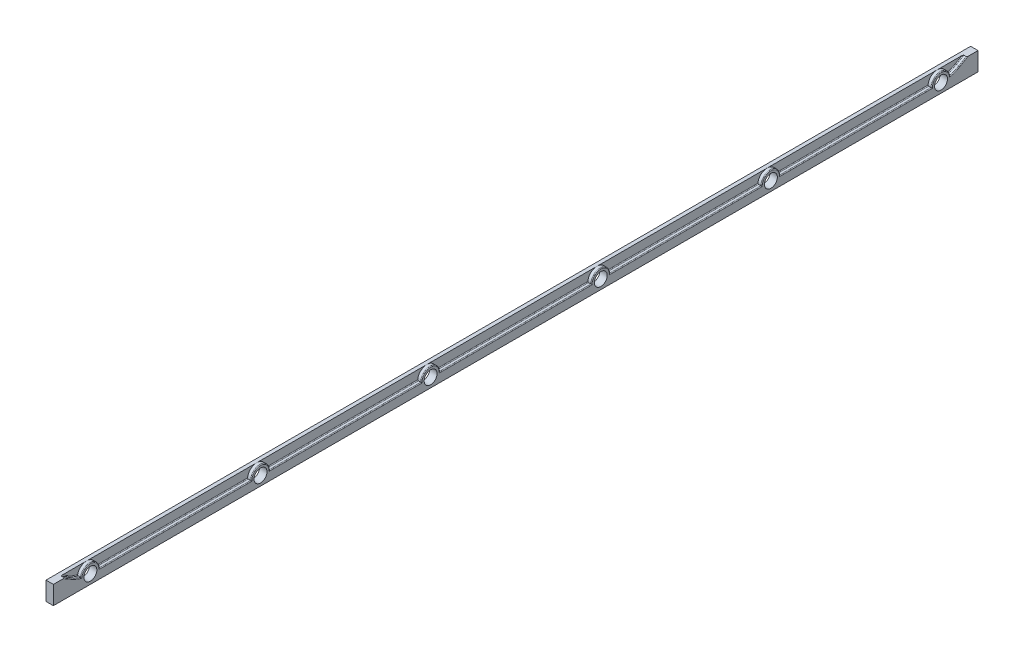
ISO-10303-21;
HEADER;
FILE_DESCRIPTION(('STEP AP214'),'2;1');
FILE_NAME('part.step','',(''),(''),'','','');
FILE_SCHEMA(('AUTOMOTIVE_DESIGN { 1 0 10303 214 1 1 1 1 }'));
ENDSEC;
DATA;
#1=APPLICATION_CONTEXT('core data for automotive mechanical design processes');
#2=APPLICATION_PROTOCOL_DEFINITION('international standard','automotive_design',2000,#1);
#3=PRODUCT_CONTEXT('',#1,'mechanical');
#4=PRODUCT('Part','Part','',(#3));
#5=PRODUCT_RELATED_PRODUCT_CATEGORY('part','',(#4));
#6=PRODUCT_DEFINITION_FORMATION('','',#4);
#7=PRODUCT_DEFINITION_CONTEXT('part definition',#1,'design');
#8=PRODUCT_DEFINITION('design','',#6,#7);
#9=PRODUCT_DEFINITION_SHAPE('','',#8);
#10=(LENGTH_UNIT() NAMED_UNIT(*) SI_UNIT(.MILLI.,.METRE.));
#11=(NAMED_UNIT(*) PLANE_ANGLE_UNIT() SI_UNIT($,.RADIAN.));
#12=(NAMED_UNIT(*) SI_UNIT($,.STERADIAN.) SOLID_ANGLE_UNIT());
#13=UNCERTAINTY_MEASURE_WITH_UNIT(LENGTH_MEASURE(1.E-05),#10,'distance_accuracy_value','');
#14=(GEOMETRIC_REPRESENTATION_CONTEXT(3) GLOBAL_UNCERTAINTY_ASSIGNED_CONTEXT((#13)) GLOBAL_UNIT_ASSIGNED_CONTEXT((#10,
#11,#12)) REPRESENTATION_CONTEXT('',''));
#15=CARTESIAN_POINT('',(0.,0.,0.));
#16=DIRECTION('',(0.,0.,1.));
#17=DIRECTION('',(1.,0.,0.));
#18=AXIS2_PLACEMENT_3D('',#15,#16,#17);
#19=CARTESIAN_POINT('',(1.,0.,0.));
#20=DIRECTION('',(1.,0.,0.));
#21=DIRECTION('',(0.,0.,-1.));
#22=AXIS2_PLACEMENT_3D('',#19,#20,#21);
#23=PLANE('',#22);
#24=DIRECTION('',(0.,0.,1.));
#25=VECTOR('',#24,1.);
#26=CARTESIAN_POINT('',(1.,2.5,-125.));
#27=LINE('',#26,#25);
#28=CARTESIAN_POINT('',(1.,2.5,-125.));
#29=VERTEX_POINT('',#28);
#30=CARTESIAN_POINT('',(1.,2.5,-122.4));
#31=VERTEX_POINT('',#30);
#32=EDGE_CURVE('E425',#29,#31,#27,.T.);
#33=ORIENTED_EDGE('',*,*,#32,.T.);
#34=DIRECTION('',(0.,0.500000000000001,-0.866025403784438));
#35=VECTOR('',#34,1.);
#36=CARTESIAN_POINT('',(1.,1.16654088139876,-120.090381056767));
#37=LINE('',#36,#35);
#38=CARTESIAN_POINT('',(1.,1.16654088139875,-120.090381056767));
#39=VERTEX_POINT('',#38);
#40=EDGE_CURVE('E475',#31,#39,#37,.F.);
#41=ORIENTED_EDGE('',*,*,#40,.T.);
#42=CARTESIAN_POINT('',(1.,10.,-114.990381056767));
#43=DIRECTION('',(1.,0.,0.));
#44=DIRECTION('',(0.,0.,-1.));
#45=AXIS2_PLACEMENT_3D('',#42,#43,#44);
#46=CIRCLE('',#45,10.2);
#47=CARTESIAN_POINT('',(1.,0.0647161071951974,-117.299089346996));
#48=VERTEX_POINT('',#47);
#49=EDGE_CURVE('E473',#39,#48,#46,.F.);
#50=ORIENTED_EDGE('',*,*,#49,.T.);
#51=CARTESIAN_POINT('',(1.,0.,-115.));
#52=DIRECTION('',(1.,0.,0.));
#53=DIRECTION('',(0.,0.,-1.));
#54=AXIS2_PLACEMENT_3D('',#51,#52,#53);
#55=CIRCLE('',#54,2.3);
#56=CARTESIAN_POINT('',(1.,-0.199999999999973,-112.708712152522));
#57=VERTEX_POINT('',#56);
#58=EDGE_CURVE('E471',#48,#57,#55,.T.);
#59=ORIENTED_EDGE('',*,*,#58,.T.);
#60=DIRECTION('',(0.,0.,-1.));
#61=VECTOR('',#60,1.);
#62=CARTESIAN_POINT('',(1.,-0.199999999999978,-71.5));
#63=LINE('',#62,#61);
#64=CARTESIAN_POINT('',(1.,-0.199999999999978,-71.2912878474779));
#65=VERTEX_POINT('',#64);
#66=EDGE_CURVE('E469',#57,#65,#63,.F.);
#67=ORIENTED_EDGE('',*,*,#66,.T.);
#68=CARTESIAN_POINT('',(1.,0.,-69.));
#69=DIRECTION('',(1.,0.,0.));
#70=DIRECTION('',(0.,0.,-1.));
#71=AXIS2_PLACEMENT_3D('',#68,#69,#70);
#72=CIRCLE('',#71,2.29999999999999);
#73=CARTESIAN_POINT('',(1.,-0.199999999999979,-66.7087121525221));
#74=VERTEX_POINT('',#73);
#75=EDGE_CURVE('E467',#65,#74,#72,.T.);
#76=ORIENTED_EDGE('',*,*,#75,.T.);
#77=DIRECTION('',(0.,0.,-1.));
#78=VECTOR('',#77,1.);
#79=CARTESIAN_POINT('',(1.,-0.199999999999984,-25.5));
#80=LINE('',#79,#78);
#81=CARTESIAN_POINT('',(1.,-0.199999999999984,-25.2912878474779));
#82=VERTEX_POINT('',#81);
#83=EDGE_CURVE('E465',#74,#82,#80,.F.);
#84=ORIENTED_EDGE('',*,*,#83,.T.);
#85=CARTESIAN_POINT('',(1.,0.,-23.));
#86=DIRECTION('',(1.,0.,0.));
#87=DIRECTION('',(0.,0.,-1.));
#88=AXIS2_PLACEMENT_3D('',#85,#86,#87);
#89=CIRCLE('',#88,2.29999999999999);
#90=CARTESIAN_POINT('',(1.,-0.199999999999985,-20.7087121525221));
#91=VERTEX_POINT('',#90);
#92=EDGE_CURVE('E463',#82,#91,#89,.T.);
#93=ORIENTED_EDGE('',*,*,#92,.T.);
#94=DIRECTION('',(0.,0.,-1.));
#95=VECTOR('',#94,1.);
#96=CARTESIAN_POINT('',(1.,-0.19999999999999,20.5));
#97=LINE('',#96,#95);
#98=CARTESIAN_POINT('',(1.,-0.19999999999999,20.7087121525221));
#99=VERTEX_POINT('',#98);
#100=EDGE_CURVE('E461',#91,#99,#97,.F.);
#101=ORIENTED_EDGE('',*,*,#100,.T.);
#102=CARTESIAN_POINT('',(1.,0.,23.));
#103=DIRECTION('',(1.,0.,0.));
#104=DIRECTION('',(0.,0.,-1.));
#105=AXIS2_PLACEMENT_3D('',#102,#103,#104);
#106=CIRCLE('',#105,2.29999999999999);
#107=CARTESIAN_POINT('',(1.,-0.19999999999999,25.2912878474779));
#108=VERTEX_POINT('',#107);
#109=EDGE_CURVE('E455',#99,#108,#106,.T.);
#110=ORIENTED_EDGE('',*,*,#109,.T.);
#111=DIRECTION('',(0.,0.,-1.));
#112=VECTOR('',#111,1.);
#113=CARTESIAN_POINT('',(1.,-0.199999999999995,66.5));
#114=LINE('',#113,#112);
#115=CARTESIAN_POINT('',(1.,-0.199999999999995,66.7087121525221));
#116=VERTEX_POINT('',#115);
#117=EDGE_CURVE('E451',#108,#116,#114,.F.);
#118=ORIENTED_EDGE('',*,*,#117,.T.);
#119=CARTESIAN_POINT('',(1.,0.,69.));
#120=DIRECTION('',(1.,0.,0.));
#121=DIRECTION('',(0.,0.,-1.));
#122=AXIS2_PLACEMENT_3D('',#119,#120,#121);
#123=CIRCLE('',#122,2.29999999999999);
#124=CARTESIAN_POINT('',(1.,-0.199999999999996,71.2912878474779));
#125=VERTEX_POINT('',#124);
#126=EDGE_CURVE('E447',#116,#125,#123,.T.);
#127=ORIENTED_EDGE('',*,*,#126,.T.);
#128=DIRECTION('',(0.,0.,-1.));
#129=VECTOR('',#128,1.);
#130=CARTESIAN_POINT('',(1.,-0.200000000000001,112.5));
#131=LINE('',#130,#129);
#132=CARTESIAN_POINT('',(1.,-0.200000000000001,112.708712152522));
#133=VERTEX_POINT('',#132);
#134=EDGE_CURVE('E449',#125,#133,#131,.F.);
#135=ORIENTED_EDGE('',*,*,#134,.T.);
#136=CARTESIAN_POINT('',(1.,0.,115.));
#137=DIRECTION('',(1.,0.,0.));
#138=DIRECTION('',(0.,0.,-1.));
#139=AXIS2_PLACEMENT_3D('',#136,#137,#138);
#140=CIRCLE('',#139,2.29999999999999);
#141=CARTESIAN_POINT('',(1.,0.0647161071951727,117.299089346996));
#142=VERTEX_POINT('',#141);
#143=EDGE_CURVE('E453',#133,#142,#140,.T.);
#144=ORIENTED_EDGE('',*,*,#143,.T.);
#145=CARTESIAN_POINT('',(1.,10.,114.990381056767));
#146=DIRECTION('',(1.,0.,0.));
#147=DIRECTION('',(0.,0.,-1.));
#148=AXIS2_PLACEMENT_3D('',#145,#146,#147);
#149=CIRCLE('',#148,10.2);
#150=CARTESIAN_POINT('',(1.,1.16654088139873,120.090381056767));
#151=VERTEX_POINT('',#150);
#152=EDGE_CURVE('E457',#142,#151,#149,.F.);
#153=ORIENTED_EDGE('',*,*,#152,.T.);
#154=DIRECTION('',(0.,-0.500000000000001,-0.866025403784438));
#155=VECTOR('',#154,1.);
#156=CARTESIAN_POINT('',(1.,2.32679491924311,122.1));
#157=LINE('',#156,#155);
#158=CARTESIAN_POINT('',(1.,2.5,122.4));
#159=VERTEX_POINT('',#158);
#160=EDGE_CURVE('E459',#151,#159,#157,.F.);
#161=ORIENTED_EDGE('',*,*,#160,.T.);
#162=CARTESIAN_POINT('',(1.,2.5,125.));
#163=VERTEX_POINT('',#162);
#164=EDGE_CURVE('E424',#159,#163,#27,.T.);
#165=ORIENTED_EDGE('',*,*,#164,.T.);
#166=DIRECTION('',(0.,-1.,0.));
#167=VECTOR('',#166,1.);
#168=CARTESIAN_POINT('',(1.,2.5,125.));
#169=LINE('',#168,#167);
#170=CARTESIAN_POINT('',(1.,-2.5,125.));
#171=VERTEX_POINT('',#170);
#172=EDGE_CURVE('E409',#163,#171,#169,.T.);
#173=ORIENTED_EDGE('',*,*,#172,.T.);
#174=DIRECTION('',(0.,0.,-1.));
#175=VECTOR('',#174,1.);
#176=CARTESIAN_POINT('',(1.,-2.5,125.));
#177=LINE('',#176,#175);
#178=CARTESIAN_POINT('',(1.,-2.5,-125.));
#179=VERTEX_POINT('',#178);
#180=EDGE_CURVE('E399',#171,#179,#177,.T.);
#181=ORIENTED_EDGE('',*,*,#180,.T.);
#182=DIRECTION('',(0.,1.,0.));
#183=VECTOR('',#182,1.);
#184=CARTESIAN_POINT('',(1.,-2.5,-125.));
#185=LINE('',#184,#183);
#186=EDGE_CURVE('E421',#179,#29,#185,.T.);
#187=ORIENTED_EDGE('',*,*,#186,.T.);
#188=EDGE_LOOP('',(#33,#41,#50,#59,#67,#76,#84,#93,#101,#110,#118,#127,#135,#144,#153,#161,#165,
#173,#181,#187));
#189=FACE_BOUND('',#188,.T.);
#190=CARTESIAN_POINT('',(1.,0.,69.));
#191=DIRECTION('',(1.,0.,0.));
#192=DIRECTION('',(0.,0.,-1.));
#193=AXIS2_PLACEMENT_3D('',#190,#191,#192);
#194=CIRCLE('',#193,1.75);
#195=CARTESIAN_POINT('',(1.,0.,67.25));
#196=VERTEX_POINT('',#195);
#197=EDGE_CURVE('E697',#196,#196,#194,.T.);
#198=ORIENTED_EDGE('',*,*,#197,.F.);
#199=EDGE_LOOP('',(#198));
#200=FACE_BOUND('',#199,.T.);
#201=CARTESIAN_POINT('',(1.,0.,23.));
#202=DIRECTION('',(1.,0.,0.));
#203=DIRECTION('',(0.,0.,-1.));
#204=AXIS2_PLACEMENT_3D('',#201,#202,#203);
#205=CIRCLE('',#204,1.75);
#206=CARTESIAN_POINT('',(1.,0.,21.25));
#207=VERTEX_POINT('',#206);
#208=EDGE_CURVE('E754',#207,#207,#205,.T.);
#209=ORIENTED_EDGE('',*,*,#208,.F.);
#210=EDGE_LOOP('',(#209));
#211=FACE_BOUND('',#210,.T.);
#212=CARTESIAN_POINT('',(1.,0.,-23.));
#213=DIRECTION('',(1.,0.,0.));
#214=DIRECTION('',(0.,0.,-1.));
#215=AXIS2_PLACEMENT_3D('',#212,#213,#214);
#216=CIRCLE('',#215,1.75);
#217=CARTESIAN_POINT('',(1.,0.,-24.75));
#218=VERTEX_POINT('',#217);
#219=EDGE_CURVE('E748',#218,#218,#216,.T.);
#220=ORIENTED_EDGE('',*,*,#219,.F.);
#221=EDGE_LOOP('',(#220));
#222=FACE_BOUND('',#221,.T.);
#223=CARTESIAN_POINT('',(1.,0.,-69.));
#224=DIRECTION('',(1.,0.,0.));
#225=DIRECTION('',(0.,0.,-1.));
#226=AXIS2_PLACEMENT_3D('',#223,#224,#225);
#227=CIRCLE('',#226,1.75);
#228=CARTESIAN_POINT('',(1.,0.,-70.75));
#229=VERTEX_POINT('',#228);
#230=EDGE_CURVE('E742',#229,#229,#227,.T.);
#231=ORIENTED_EDGE('',*,*,#230,.F.);
#232=EDGE_LOOP('',(#231));
#233=FACE_BOUND('',#232,.T.);
#234=CARTESIAN_POINT('',(1.,0.,-115.));
#235=DIRECTION('',(1.,0.,0.));
#236=DIRECTION('',(0.,0.,-1.));
#237=AXIS2_PLACEMENT_3D('',#234,#235,#236);
#238=CIRCLE('',#237,1.75);
#239=CARTESIAN_POINT('',(1.,0.,-116.75));
#240=VERTEX_POINT('',#239);
#241=EDGE_CURVE('E736',#240,#240,#238,.T.);
#242=ORIENTED_EDGE('',*,*,#241,.F.);
#243=EDGE_LOOP('',(#242));
#244=FACE_BOUND('',#243,.T.);
#245=CARTESIAN_POINT('',(1.,0.,115.));
#246=DIRECTION('',(1.,0.,0.));
#247=DIRECTION('',(0.,0.,-1.));
#248=AXIS2_PLACEMENT_3D('',#245,#246,#247);
#249=CIRCLE('',#248,1.75);
#250=CARTESIAN_POINT('',(1.,0.,113.25));
#251=VERTEX_POINT('',#250);
#252=EDGE_CURVE('E730',#251,#251,#249,.T.);
#253=ORIENTED_EDGE('',*,*,#252,.F.);
#254=EDGE_LOOP('',(#253));
#255=FACE_BOUND('',#254,.T.);
#256=ADVANCED_FACE('F33',(#189,#200,#211,#222,#233,#244,#255),#23,.T.);
#257=CARTESIAN_POINT('',(-1.,2.5,-125.));
#258=DIRECTION('',(0.,1.,0.));
#259=DIRECTION('',(0.,0.,1.));
#260=AXIS2_PLACEMENT_3D('',#257,#258,#259);
#261=PLANE('',#260);
#262=DIRECTION('',(1.,0.,0.));
#263=VECTOR('',#262,1.);
#264=CARTESIAN_POINT('',(0.,2.5,-122.));
#265=LINE('',#264,#263);
#266=CARTESIAN_POINT('',(0.200000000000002,2.5,-122.));
#267=VERTEX_POINT('',#266);
#268=CARTESIAN_POINT('',(0.799999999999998,2.5,-122.));
#269=VERTEX_POINT('',#268);
#270=EDGE_CURVE('E397',#267,#269,#265,.T.);
#271=ORIENTED_EDGE('',*,*,#270,.T.);
#272=CARTESIAN_POINT('',(0.799999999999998,2.5,-122.4));
#273=DIRECTION('',(0.,1.,0.));
#274=DIRECTION('',(0.,0.,1.));
#275=AXIS2_PLACEMENT_3D('',#272,#273,#274);
#276=ELLIPSE('',#275,0.400000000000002,0.200000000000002);
#277=EDGE_CURVE('E445',#269,#31,#276,.T.);
#278=ORIENTED_EDGE('',*,*,#277,.T.);
#279=ORIENTED_EDGE('',*,*,#32,.F.);
#280=DIRECTION('',(1.,0.,0.));
#281=VECTOR('',#280,1.);
#282=CARTESIAN_POINT('',(-1.,2.5,-125.));
#283=LINE('',#282,#281);
#284=CARTESIAN_POINT('',(-1.,2.5,-125.));
#285=VERTEX_POINT('',#284);
#286=EDGE_CURVE('E436',#285,#29,#283,.T.);
#287=ORIENTED_EDGE('',*,*,#286,.F.);
#288=DIRECTION('',(0.,0.,1.));
#289=VECTOR('',#288,1.);
#290=CARTESIAN_POINT('',(-1.,2.5,-125.));
#291=LINE('',#290,#289);
#292=CARTESIAN_POINT('',(-1.,2.5,125.));
#293=VERTEX_POINT('',#292);
#294=EDGE_CURVE('E412',#285,#293,#291,.T.);
#295=ORIENTED_EDGE('',*,*,#294,.T.);
#296=DIRECTION('',(1.,0.,0.));
#297=VECTOR('',#296,1.);
#298=CARTESIAN_POINT('',(-1.,2.5,125.));
#299=LINE('',#298,#297);
#300=EDGE_CURVE('E433',#293,#163,#299,.T.);
#301=ORIENTED_EDGE('',*,*,#300,.T.);
#302=ORIENTED_EDGE('',*,*,#164,.F.);
#303=CARTESIAN_POINT('',(0.799999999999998,2.5,122.4));
#304=DIRECTION('',(0.,1.,0.));
#305=DIRECTION('',(0.,0.,1.));
#306=AXIS2_PLACEMENT_3D('',#303,#304,#305);
#307=ELLIPSE('',#306,0.400000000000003,0.200000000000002);
#308=CARTESIAN_POINT('',(0.799999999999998,2.5,122.));
#309=VERTEX_POINT('',#308);
#310=EDGE_CURVE('E443',#159,#309,#307,.T.);
#311=ORIENTED_EDGE('',*,*,#310,.T.);
#312=DIRECTION('',(1.,0.,0.));
#313=VECTOR('',#312,1.);
#314=CARTESIAN_POINT('',(0.,2.5,122.));
#315=LINE('',#314,#313);
#316=CARTESIAN_POINT('',(0.200000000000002,2.5,122.));
#317=VERTEX_POINT('',#316);
#318=EDGE_CURVE('E718',#317,#309,#315,.T.);
#319=ORIENTED_EDGE('',*,*,#318,.F.);
#320=CARTESIAN_POINT('',(0.200000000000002,2.5,121.6));
#321=DIRECTION('',(0.,1.,0.));
#322=DIRECTION('',(0.,0.,-1.));
#323=AXIS2_PLACEMENT_3D('',#320,#321,#322);
#324=ELLIPSE('',#323,0.400000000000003,0.200000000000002);
#325=CARTESIAN_POINT('',(0.,2.5,121.6));
#326=VERTEX_POINT('',#325);
#327=EDGE_CURVE('E11',#317,#326,#324,.F.);
#328=ORIENTED_EDGE('',*,*,#327,.T.);
#329=DIRECTION('',(0.,0.,1.));
#330=VECTOR('',#329,1.);
#331=CARTESIAN_POINT('',(0.,2.5,115.));
#332=LINE('',#331,#330);
#333=CARTESIAN_POINT('',(0.,2.5,115.));
#334=VERTEX_POINT('',#333);
#335=EDGE_CURVE('E290',#334,#326,#332,.T.);
#336=ORIENTED_EDGE('',*,*,#335,.F.);
#337=DIRECTION('',(0.,0.,1.));
#338=VECTOR('',#337,1.);
#339=CARTESIAN_POINT('',(0.,2.5,69.));
#340=LINE('',#339,#338);
#341=CARTESIAN_POINT('',(0.,2.5,69.));
#342=VERTEX_POINT('',#341);
#343=EDGE_CURVE('E303',#342,#334,#340,.T.);
#344=ORIENTED_EDGE('',*,*,#343,.F.);
#345=DIRECTION('',(0.,0.,1.));
#346=VECTOR('',#345,1.);
#347=CARTESIAN_POINT('',(0.,2.5,23.));
#348=LINE('',#347,#346);
#349=CARTESIAN_POINT('',(0.,2.5,23.));
#350=VERTEX_POINT('',#349);
#351=EDGE_CURVE('E336',#350,#342,#348,.T.);
#352=ORIENTED_EDGE('',*,*,#351,.F.);
#353=DIRECTION('',(0.,0.,1.));
#354=VECTOR('',#353,1.);
#355=CARTESIAN_POINT('',(0.,2.5,-23.));
#356=LINE('',#355,#354);
#357=CARTESIAN_POINT('',(0.,2.5,-23.));
#358=VERTEX_POINT('',#357);
#359=EDGE_CURVE('E350',#358,#350,#356,.T.);
#360=ORIENTED_EDGE('',*,*,#359,.F.);
#361=DIRECTION('',(0.,0.,1.));
#362=VECTOR('',#361,1.);
#363=CARTESIAN_POINT('',(0.,2.5,-69.));
#364=LINE('',#363,#362);
#365=CARTESIAN_POINT('',(0.,2.5,-69.));
#366=VERTEX_POINT('',#365);
#367=EDGE_CURVE('E364',#366,#358,#364,.T.);
#368=ORIENTED_EDGE('',*,*,#367,.F.);
#369=DIRECTION('',(0.,0.,1.));
#370=VECTOR('',#369,1.);
#371=CARTESIAN_POINT('',(0.,2.5,-115.));
#372=LINE('',#371,#370);
#373=CARTESIAN_POINT('',(0.,2.5,-115.));
#374=VERTEX_POINT('',#373);
#375=EDGE_CURVE('E378',#374,#366,#372,.T.);
#376=ORIENTED_EDGE('',*,*,#375,.F.);
#377=DIRECTION('',(0.,0.,1.));
#378=VECTOR('',#377,1.);
#379=CARTESIAN_POINT('',(0.,2.5,-122.));
#380=LINE('',#379,#378);
#381=CARTESIAN_POINT('',(0.,2.5,-121.6));
#382=VERTEX_POINT('',#381);
#383=EDGE_CURVE('E393',#382,#374,#380,.T.);
#384=ORIENTED_EDGE('',*,*,#383,.F.);
#385=CARTESIAN_POINT('',(0.200000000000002,2.5,-121.6));
#386=DIRECTION('',(0.,1.,0.));
#387=DIRECTION('',(0.,0.,1.));
#388=AXIS2_PLACEMENT_3D('',#385,#386,#387);
#389=ELLIPSE('',#388,0.400000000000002,0.200000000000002);
#390=EDGE_CURVE('E42',#382,#267,#389,.F.);
#391=ORIENTED_EDGE('',*,*,#390,.T.);
#392=EDGE_LOOP('',(#271,#278,#279,#287,#295,#301,#302,#311,#319,#328,#336,#344,#352,#360,#368,
#376,#384,#391));
#393=FACE_BOUND('',#392,.T.);
#394=ADVANCED_FACE('F300',(#393),#261,.T.);
#395=CARTESIAN_POINT('',(-1.,-2.5,125.));
#396=DIRECTION('',(0.,-1.,0.));
#397=DIRECTION('',(0.,0.,-1.));
#398=AXIS2_PLACEMENT_3D('',#395,#396,#397);
#399=PLANE('',#398);
#400=ORIENTED_EDGE('',*,*,#180,.F.);
#401=DIRECTION('',(1.,0.,0.));
#402=VECTOR('',#401,1.);
#403=CARTESIAN_POINT('',(-1.,-2.5,125.));
#404=LINE('',#403,#402);
#405=CARTESIAN_POINT('',(-1.,-2.5,125.));
#406=VERTEX_POINT('',#405);
#407=EDGE_CURVE('E430',#406,#171,#404,.T.);
#408=ORIENTED_EDGE('',*,*,#407,.F.);
#409=DIRECTION('',(0.,0.,-1.));
#410=VECTOR('',#409,1.);
#411=CARTESIAN_POINT('',(-1.,-2.5,125.));
#412=LINE('',#411,#410);
#413=CARTESIAN_POINT('',(-1.,-2.5,-125.));
#414=VERTEX_POINT('',#413);
#415=EDGE_CURVE('E405',#406,#414,#412,.T.);
#416=ORIENTED_EDGE('',*,*,#415,.T.);
#417=DIRECTION('',(1.,0.,0.));
#418=VECTOR('',#417,1.);
#419=CARTESIAN_POINT('',(-1.,-2.5,-125.));
#420=LINE('',#419,#418);
#421=EDGE_CURVE('E418',#414,#179,#420,.T.);
#422=ORIENTED_EDGE('',*,*,#421,.T.);
#423=EDGE_LOOP('',(#400,#408,#416,#422));
#424=FACE_BOUND('',#423,.T.);
#425=ADVANCED_FACE('F519',(#424),#399,.T.);
#426=CARTESIAN_POINT('',(-1.,2.5,125.));
#427=DIRECTION('',(0.,0.,1.));
#428=DIRECTION('',(1.,0.,0.));
#429=AXIS2_PLACEMENT_3D('',#426,#427,#428);
#430=PLANE('',#429);
#431=ORIENTED_EDGE('',*,*,#172,.F.);
#432=ORIENTED_EDGE('',*,*,#300,.F.);
#433=DIRECTION('',(0.,-1.,0.));
#434=VECTOR('',#433,1.);
#435=CARTESIAN_POINT('',(-1.,2.5,125.));
#436=LINE('',#435,#434);
#437=EDGE_CURVE('E415',#293,#406,#436,.T.);
#438=ORIENTED_EDGE('',*,*,#437,.T.);
#439=ORIENTED_EDGE('',*,*,#407,.T.);
#440=EDGE_LOOP('',(#431,#432,#438,#439));
#441=FACE_BOUND('',#440,.T.);
#442=ADVANCED_FACE('F516',(#441),#430,.T.);
#443=CARTESIAN_POINT('',(-1.,-2.5,-125.));
#444=DIRECTION('',(0.,0.,-1.));
#445=DIRECTION('',(-1.,0.,0.));
#446=AXIS2_PLACEMENT_3D('',#443,#444,#445);
#447=PLANE('',#446);
#448=ORIENTED_EDGE('',*,*,#186,.F.);
#449=ORIENTED_EDGE('',*,*,#421,.F.);
#450=DIRECTION('',(0.,1.,0.));
#451=VECTOR('',#450,1.);
#452=CARTESIAN_POINT('',(-1.,-2.5,-125.));
#453=LINE('',#452,#451);
#454=EDGE_CURVE('E408',#414,#285,#453,.T.);
#455=ORIENTED_EDGE('',*,*,#454,.T.);
#456=ORIENTED_EDGE('',*,*,#286,.T.);
#457=EDGE_LOOP('',(#448,#449,#455,#456));
#458=FACE_BOUND('',#457,.T.);
#459=ADVANCED_FACE('F511',(#458),#447,.T.);
#460=CARTESIAN_POINT('',(-1.,0.,0.));
#461=DIRECTION('',(1.,0.,0.));
#462=DIRECTION('',(0.,0.,-1.));
#463=AXIS2_PLACEMENT_3D('',#460,#461,#462);
#464=PLANE('',#463);
#465=CARTESIAN_POINT('',(-1.,0.,69.));
#466=DIRECTION('',(1.,0.,0.));
#467=DIRECTION('',(0.,0.,-1.));
#468=AXIS2_PLACEMENT_3D('',#465,#466,#467);
#469=CIRCLE('',#468,1.75);
#470=CARTESIAN_POINT('',(-1.,0.,67.25));
#471=VERTEX_POINT('',#470);
#472=EDGE_CURVE('E702',#471,#471,#469,.T.);
#473=ORIENTED_EDGE('',*,*,#472,.T.);
#474=EDGE_LOOP('',(#473));
#475=FACE_BOUND('',#474,.T.);
#476=CARTESIAN_POINT('',(-1.,0.,23.));
#477=DIRECTION('',(1.,0.,0.));
#478=DIRECTION('',(0.,0.,-1.));
#479=AXIS2_PLACEMENT_3D('',#476,#477,#478);
#480=CIRCLE('',#479,1.75);
#481=CARTESIAN_POINT('',(-1.,0.,21.25));
#482=VERTEX_POINT('',#481);
#483=EDGE_CURVE('E751',#482,#482,#480,.T.);
#484=ORIENTED_EDGE('',*,*,#483,.T.);
#485=EDGE_LOOP('',(#484));
#486=FACE_BOUND('',#485,.T.);
#487=CARTESIAN_POINT('',(-1.,0.,-23.));
#488=DIRECTION('',(1.,0.,0.));
#489=DIRECTION('',(0.,0.,-1.));
#490=AXIS2_PLACEMENT_3D('',#487,#488,#489);
#491=CIRCLE('',#490,1.75);
#492=CARTESIAN_POINT('',(-1.,0.,-24.75));
#493=VERTEX_POINT('',#492);
#494=EDGE_CURVE('E745',#493,#493,#491,.T.);
#495=ORIENTED_EDGE('',*,*,#494,.T.);
#496=EDGE_LOOP('',(#495));
#497=FACE_BOUND('',#496,.T.);
#498=CARTESIAN_POINT('',(-1.,0.,-69.));
#499=DIRECTION('',(1.,0.,0.));
#500=DIRECTION('',(0.,0.,-1.));
#501=AXIS2_PLACEMENT_3D('',#498,#499,#500);
#502=CIRCLE('',#501,1.75);
#503=CARTESIAN_POINT('',(-1.,0.,-70.75));
#504=VERTEX_POINT('',#503);
#505=EDGE_CURVE('E739',#504,#504,#502,.T.);
#506=ORIENTED_EDGE('',*,*,#505,.T.);
#507=EDGE_LOOP('',(#506));
#508=FACE_BOUND('',#507,.T.);
#509=CARTESIAN_POINT('',(-1.,0.,-115.));
#510=DIRECTION('',(1.,0.,0.));
#511=DIRECTION('',(0.,0.,-1.));
#512=AXIS2_PLACEMENT_3D('',#509,#510,#511);
#513=CIRCLE('',#512,1.75);
#514=CARTESIAN_POINT('',(-1.,0.,-116.75));
#515=VERTEX_POINT('',#514);
#516=EDGE_CURVE('E733',#515,#515,#513,.T.);
#517=ORIENTED_EDGE('',*,*,#516,.T.);
#518=EDGE_LOOP('',(#517));
#519=FACE_BOUND('',#518,.T.);
#520=CARTESIAN_POINT('',(-1.,0.,115.));
#521=DIRECTION('',(1.,0.,0.));
#522=DIRECTION('',(0.,0.,-1.));
#523=AXIS2_PLACEMENT_3D('',#520,#521,#522);
#524=CIRCLE('',#523,1.75);
#525=CARTESIAN_POINT('',(-1.,0.,113.25));
#526=VERTEX_POINT('',#525);
#527=EDGE_CURVE('E295',#526,#526,#524,.T.);
#528=ORIENTED_EDGE('',*,*,#527,.T.);
#529=EDGE_LOOP('',(#528));
#530=FACE_BOUND('',#529,.T.);
#531=ORIENTED_EDGE('',*,*,#415,.F.);
#532=ORIENTED_EDGE('',*,*,#437,.F.);
#533=ORIENTED_EDGE('',*,*,#294,.F.);
#534=ORIENTED_EDGE('',*,*,#454,.F.);
#535=EDGE_LOOP('',(#531,#532,#533,#534));
#536=FACE_BOUND('',#535,.T.);
#537=ADVANCED_FACE('F504',(#475,#486,#497,#508,#519,#530,#536),#464,.F.);
#538=CARTESIAN_POINT('',(0.,0.,-115.));
#539=DIRECTION('',(1.,0.,0.));
#540=DIRECTION('',(0.,0.,-1.));
#541=AXIS2_PLACEMENT_3D('',#538,#539,#540);
#542=CYLINDRICAL_SURFACE('',#541,2.5);
#543=DIRECTION('',(1.,0.,0.));
#544=VECTOR('',#543,1.);
#545=CARTESIAN_POINT('',(0.,0.,-112.5));
#546=LINE('',#545,#544);
#547=CARTESIAN_POINT('',(0.200000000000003,0.,-112.5));
#548=VERTEX_POINT('',#547);
#549=CARTESIAN_POINT('',(0.799999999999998,0.,-112.5));
#550=VERTEX_POINT('',#549);
#551=EDGE_CURVE('E385',#548,#550,#546,.T.);
#552=ORIENTED_EDGE('',*,*,#551,.T.);
#553=CARTESIAN_POINT('',(0.799999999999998,0.,-115.));
#554=DIRECTION('',(1.,0.,0.));
#555=DIRECTION('',(0.,0.,-1.));
#556=AXIS2_PLACEMENT_3D('',#553,#554,#555);
#557=CIRCLE('',#556,2.5);
#558=CARTESIAN_POINT('',(0.799999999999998,0.31489021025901,-117.48008954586));
#559=VERTEX_POINT('',#558);
#560=EDGE_CURVE('E965',#550,#559,#557,.F.);
#561=ORIENTED_EDGE('',*,*,#560,.T.);
#562=DIRECTION('',(1.,0.,0.));
#563=VECTOR('',#562,1.);
#564=CARTESIAN_POINT('',(0.,0.31489021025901,-117.48008954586));
#565=LINE('',#564,#563);
#566=CARTESIAN_POINT('',(0.200000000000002,0.31489021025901,-117.48008954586));
#567=VERTEX_POINT('',#566);
#568=EDGE_CURVE('E396',#567,#559,#565,.T.);
#569=ORIENTED_EDGE('',*,*,#568,.F.);
#570=CARTESIAN_POINT('',(0.200000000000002,0.31489021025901,-117.48008954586));
#571=CARTESIAN_POINT('',(0.188800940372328,0.31487988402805,-117.480088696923));
#572=CARTESIAN_POINT('',(0.177605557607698,0.315830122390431,-117.479970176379));
#573=CARTESIAN_POINT('',(0.155544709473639,0.319574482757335,-117.479491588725));
#574=CARTESIAN_POINT('',(0.144678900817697,0.322366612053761,-117.47913178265));
#575=CARTESIAN_POINT('',(0.123570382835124,0.329719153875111,-117.478164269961));
#576=CARTESIAN_POINT('',(0.113327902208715,0.334280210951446,-117.47755647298));
#577=CARTESIAN_POINT('',(0.0937565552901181,0.345027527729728,-117.476082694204));
#578=CARTESIAN_POINT('',(0.0844276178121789,0.351213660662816,-117.475216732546));
#579=CARTESIAN_POINT('',(0.0669004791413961,0.365058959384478,-117.473212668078));
#580=CARTESIAN_POINT('',(0.0587075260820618,0.372724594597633,-117.4720733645));
#581=CARTESIAN_POINT('',(0.0437268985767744,0.389287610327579,-117.469519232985));
#582=CARTESIAN_POINT('',(0.036939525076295,0.398185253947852,-117.468104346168));
#583=CARTESIAN_POINT('',(0.0249263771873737,0.417006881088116,-117.464994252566));
#584=CARTESIAN_POINT('',(0.019709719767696,0.426936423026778,-117.46329749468));
#585=CARTESIAN_POINT('',(0.0110410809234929,0.447490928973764,-117.459646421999));
#586=CARTESIAN_POINT('',(0.00758804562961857,0.45811547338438,-117.457692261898));
#587=CARTESIAN_POINT('',(0.00338391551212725,0.476145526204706,-117.454249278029));
#588=CARTESIAN_POINT('',(0.0021161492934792,0.483446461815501,-117.452821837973));
#589=CARTESIAN_POINT('',(0.000424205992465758,0.498118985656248,-117.449884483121));
#590=CARTESIAN_POINT('',(-1.06592023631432E-06,0.505490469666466,-117.448374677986));
#591=CARTESIAN_POINT('',(-1.37077263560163E-12,0.512858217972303,-117.446829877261));
#592=B_SPLINE_CURVE_WITH_KNOTS('',3,(#570,#571,#572,#573,#574,#575,#576,#577,#578,#579,#580,
#581,#582,#583,#584,#585,#586,#587,#588,#589,#590,#591),.UNSPECIFIED.,.F.,.F.,(4,2,2,2,2,2,2,2,
2,2,4),(0.,0.0335508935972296,0.0670655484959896,0.100592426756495,0.134116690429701,
0.167791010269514,0.201472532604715,0.235345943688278,0.269199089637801,0.291793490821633,
0.314358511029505),.UNSPECIFIED.);
#593=CARTESIAN_POINT('',(0.,0.512858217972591,-117.446829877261));
#594=VERTEX_POINT('',#593);
#595=EDGE_CURVE('E488',#567,#594,#592,.T.);
#596=ORIENTED_EDGE('',*,*,#595,.T.);
#597=CARTESIAN_POINT('',(0.,0.,-115.));
#598=DIRECTION('',(-1.,0.,0.));
#599=DIRECTION('',(0.,0.,1.));
#600=AXIS2_PLACEMENT_3D('',#597,#598,#599);
#601=CIRCLE('',#600,2.5);
#602=EDGE_CURVE('E388',#374,#594,#601,.T.);
#603=ORIENTED_EDGE('',*,*,#602,.F.);
#604=CARTESIAN_POINT('',(0.,0.,-115.));
#605=DIRECTION('',(-1.,0.,0.));
#606=DIRECTION('',(0.,0.,1.));
#607=AXIS2_PLACEMENT_3D('',#604,#605,#606);
#608=CIRCLE('',#607,2.49999999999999);
#609=CARTESIAN_POINT('',(0.,0.20000000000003,-112.508012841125));
#610=VERTEX_POINT('',#609);
#611=EDGE_CURVE('E374',#610,#374,#608,.T.);
#612=ORIENTED_EDGE('',*,*,#611,.F.);
#613=CARTESIAN_POINT('',(0.,0.20000000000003,-112.508012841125));
#614=CARTESIAN_POINT('',(-9.78912908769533E-06,0.188788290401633,-112.507110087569));
#615=CARTESIAN_POINT('',(0.000942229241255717,0.177572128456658,-112.506288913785));
#616=CARTESIAN_POINT('',(0.00470469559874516,0.155452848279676,-112.504813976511));
#617=CARTESIAN_POINT('',(0.0075137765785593,0.144549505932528,-112.504160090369));
#618=CARTESIAN_POINT('',(0.0149275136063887,0.123354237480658,-112.503022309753));
#619=CARTESIAN_POINT('',(0.0195332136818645,0.113062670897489,-112.502538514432));
#620=CARTESIAN_POINT('',(0.0304074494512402,0.0933954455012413,-112.501725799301));
#621=CARTESIAN_POINT('',(0.0366756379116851,0.084019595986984,-112.50139684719));
#622=CARTESIAN_POINT('',(0.0506867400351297,0.0664654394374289,-112.500868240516));
#623=CARTESIAN_POINT('',(0.0584271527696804,0.0582851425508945,-112.500668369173));
#624=CARTESIAN_POINT('',(0.0751721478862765,0.0433347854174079,-112.500364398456));
#625=CARTESIAN_POINT('',(0.0841769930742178,0.03656501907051,-112.500260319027));
#626=CARTESIAN_POINT('',(0.103201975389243,0.0246248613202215,-112.50011411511));
#627=CARTESIAN_POINT('',(0.113223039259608,0.0194559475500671,-112.500072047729));
#628=CARTESIAN_POINT('',(0.133988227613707,0.0108744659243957,-112.500019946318));
#629=CARTESIAN_POINT('',(0.144731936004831,0.00746089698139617,-112.500009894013));
#630=CARTESIAN_POINT('',(0.162949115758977,0.00332024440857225,-112.500001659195));
#631=CARTESIAN_POINT('',(0.170309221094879,0.00207595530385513,-112.500000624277));
#632=CARTESIAN_POINT('',(0.185111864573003,0.000415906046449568,-112.499999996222));
#633=CARTESIAN_POINT('',(0.19255427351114,-1.00658017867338E-06,-112.500000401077));
#634=CARTESIAN_POINT('',(0.200000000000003,0.,-112.5));
#635=B_SPLINE_CURVE_WITH_KNOTS('',3,(#613,#614,#615,#616,#617,#618,#619,#620,#621,#622,#623,
#624,#625,#626,#627,#628,#629,#630,#631,#632,#633,#634),.UNSPECIFIED.,.F.,.F.,(4,2,2,2,2,2,2,2,
2,2,4),(0.,0.0337004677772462,0.0673761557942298,0.101071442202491,0.134759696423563,
0.168391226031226,0.202029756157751,0.235699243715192,0.269349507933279,0.291699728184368,
0.31401879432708),.UNSPECIFIED.);
#636=EDGE_CURVE('E481',#610,#548,#635,.T.);
#637=ORIENTED_EDGE('',*,*,#636,.T.);
#638=EDGE_LOOP('',(#552,#561,#569,#596,#603,#612,#637));
#639=FACE_BOUND('',#638,.T.);
#640=ADVANCED_FACE('F498',(#639),#542,.T.);
#641=CARTESIAN_POINT('',(0.,1.33974596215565,-119.990381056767));
#642=DIRECTION('',(0.,-0.866025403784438,-0.500000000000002));
#643=DIRECTION('',(0.,0.500000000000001,-0.866025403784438));
#644=AXIS2_PLACEMENT_3D('',#641,#642,#643);
#645=PLANE('',#644);
#646=DIRECTION('',(1.,0.,0.));
#647=VECTOR('',#646,1.);
#648=CARTESIAN_POINT('',(0.,1.33974596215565,-119.990381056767));
#649=LINE('',#648,#647);
#650=CARTESIAN_POINT('',(0.200000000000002,1.33974596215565,-119.990381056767));
#651=VERTEX_POINT('',#650);
#652=CARTESIAN_POINT('',(0.799999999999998,1.33974596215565,-119.990381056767));
#653=VERTEX_POINT('',#652);
#654=EDGE_CURVE('E400',#651,#653,#649,.T.);
#655=ORIENTED_EDGE('',*,*,#654,.T.);
#656=DIRECTION('',(0.,0.500000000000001,-0.866025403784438));
#657=VECTOR('',#656,1.);
#658=CARTESIAN_POINT('',(0.799999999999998,2.5,-122.));
#659=LINE('',#658,#657);
#660=EDGE_CURVE('E440',#653,#269,#659,.T.);
#661=ORIENTED_EDGE('',*,*,#660,.T.);
#662=ORIENTED_EDGE('',*,*,#270,.F.);
#663=DIRECTION('',(0.,0.500000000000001,-0.866025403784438));
#664=VECTOR('',#663,1.);
#665=CARTESIAN_POINT('',(0.200000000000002,1.33974596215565,-119.990381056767));
#666=LINE('',#665,#664);
#667=EDGE_CURVE('E432',#267,#651,#666,.F.);
#668=ORIENTED_EDGE('',*,*,#667,.T.);
#669=EDGE_LOOP('',(#655,#661,#662,#668));
#670=FACE_BOUND('',#669,.T.);
#671=ADVANCED_FACE('F503',(#670),#645,.F.);
#672=CARTESIAN_POINT('',(0.,10.,-114.990381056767));
#673=DIRECTION('',(1.,0.,0.));
#674=DIRECTION('',(0.,0.,-1.));
#675=AXIS2_PLACEMENT_3D('',#672,#673,#674);
#676=CYLINDRICAL_SURFACE('',#675,10.);
#677=ORIENTED_EDGE('',*,*,#568,.T.);
#678=CARTESIAN_POINT('',(0.799999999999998,10.,-114.990381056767));
#679=DIRECTION('',(1.,0.,0.));
#680=DIRECTION('',(0.,0.,-1.));
#681=AXIS2_PLACEMENT_3D('',#678,#679,#680);
#682=CIRCLE('',#681,10.);
#683=EDGE_CURVE('E479',#559,#653,#682,.T.);
#684=ORIENTED_EDGE('',*,*,#683,.T.);
#685=ORIENTED_EDGE('',*,*,#654,.F.);
#686=CARTESIAN_POINT('',(0.200000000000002,10.,-114.990381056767));
#687=DIRECTION('',(-1.,0.,0.));
#688=DIRECTION('',(0.,0.,1.));
#689=AXIS2_PLACEMENT_3D('',#686,#687,#688);
#690=CIRCLE('',#689,10.);
#691=EDGE_CURVE('E477',#651,#567,#690,.T.);
#692=ORIENTED_EDGE('',*,*,#691,.T.);
#693=EDGE_LOOP('',(#677,#684,#685,#692));
#694=FACE_BOUND('',#693,.T.);
#695=ADVANCED_FACE('F506',(#694),#676,.F.);
#696=CARTESIAN_POINT('',(0.,0.,-115.));
#697=DIRECTION('',(-1.,0.,0.));
#698=DIRECTION('',(0.,0.,1.));
#699=AXIS2_PLACEMENT_3D('',#696,#697,#698);
#700=PLANE('',#699);
#701=ORIENTED_EDGE('',*,*,#602,.T.);
#702=CARTESIAN_POINT('',(0.,10.,-114.990381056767));
#703=DIRECTION('',(-1.,0.,0.));
#704=DIRECTION('',(0.,0.,1.));
#705=AXIS2_PLACEMENT_3D('',#702,#703,#704);
#706=CIRCLE('',#705,9.8);
#707=CARTESIAN_POINT('',(0.,1.51295104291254,-119.890381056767));
#708=VERTEX_POINT('',#707);
#709=EDGE_CURVE('E972',#594,#708,#706,.F.);
#710=ORIENTED_EDGE('',*,*,#709,.T.);
#711=DIRECTION('',(0.,0.500000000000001,-0.866025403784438));
#712=VECTOR('',#711,1.);
#713=CARTESIAN_POINT('',(0.,2.67320508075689,-121.9));
#714=LINE('',#713,#712);
#715=EDGE_CURVE('E681',#708,#382,#714,.T.);
#716=ORIENTED_EDGE('',*,*,#715,.T.);
#717=ORIENTED_EDGE('',*,*,#383,.T.);
#718=EDGE_LOOP('',(#701,#710,#716,#717));
#719=FACE_BOUND('',#718,.T.);
#720=ADVANCED_FACE('F922',(#719),#700,.F.);
#721=CARTESIAN_POINT('',(0.,0.,-71.5));
#722=DIRECTION('',(0.,-1.,0.));
#723=DIRECTION('',(0.,0.,-1.));
#724=AXIS2_PLACEMENT_3D('',#721,#722,#723);
#725=PLANE('',#724);
#726=DIRECTION('',(1.,0.,0.));
#727=VECTOR('',#726,1.);
#728=CARTESIAN_POINT('',(0.,0.,-71.5));
#729=LINE('',#728,#727);
#730=CARTESIAN_POINT('',(0.200000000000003,0.,-71.5));
#731=VERTEX_POINT('',#730);
#732=CARTESIAN_POINT('',(0.799999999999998,0.,-71.5));
#733=VERTEX_POINT('',#732);
#734=EDGE_CURVE('E384',#731,#733,#729,.T.);
#735=ORIENTED_EDGE('',*,*,#734,.T.);
#736=DIRECTION('',(0.,0.,-1.));
#737=VECTOR('',#736,1.);
#738=CARTESIAN_POINT('',(0.799999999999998,0.,-112.5));
#739=LINE('',#738,#737);
#740=EDGE_CURVE('E961',#733,#550,#739,.T.);
#741=ORIENTED_EDGE('',*,*,#740,.T.);
#742=ORIENTED_EDGE('',*,*,#551,.F.);
#743=DIRECTION('',(0.,0.,-1.));
#744=VECTOR('',#743,1.);
#745=CARTESIAN_POINT('',(0.200000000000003,0.,-71.5));
#746=LINE('',#745,#744);
#747=EDGE_CURVE('E964',#548,#731,#746,.F.);
#748=ORIENTED_EDGE('',*,*,#747,.T.);
#749=EDGE_LOOP('',(#735,#741,#742,#748));
#750=FACE_BOUND('',#749,.T.);
#751=ADVANCED_FACE('F919',(#750),#725,.F.);
#752=CARTESIAN_POINT('',(0.,0.,-69.));
#753=DIRECTION('',(1.,0.,0.));
#754=DIRECTION('',(0.,0.,-1.));
#755=AXIS2_PLACEMENT_3D('',#752,#753,#754);
#756=CYLINDRICAL_SURFACE('',#755,2.49999999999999);
#757=DIRECTION('',(1.,0.,0.));
#758=VECTOR('',#757,1.);
#759=CARTESIAN_POINT('',(0.,0.,-66.5));
#760=LINE('',#759,#758);
#761=CARTESIAN_POINT('',(0.200000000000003,0.,-66.5));
#762=VERTEX_POINT('',#761);
#763=CARTESIAN_POINT('',(0.799999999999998,0.,-66.5));
#764=VERTEX_POINT('',#763);
#765=EDGE_CURVE('E371',#762,#764,#760,.T.);
#766=ORIENTED_EDGE('',*,*,#765,.T.);
#767=CARTESIAN_POINT('',(0.799999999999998,0.,-69.));
#768=DIRECTION('',(1.,0.,0.));
#769=DIRECTION('',(0.,0.,-1.));
#770=AXIS2_PLACEMENT_3D('',#767,#768,#769);
#771=CIRCLE('',#770,2.49999999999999);
#772=EDGE_CURVE('E941',#764,#733,#771,.F.);
#773=ORIENTED_EDGE('',*,*,#772,.T.);
#774=ORIENTED_EDGE('',*,*,#734,.F.);
#775=CARTESIAN_POINT('',(0.200000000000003,0.,-71.5));
#776=CARTESIAN_POINT('',(0.188749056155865,-9.55541328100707E-06,-71.4999978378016));
#777=CARTESIAN_POINT('',(0.177500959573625,0.000948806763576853,-71.4999999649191));
#778=CARTESIAN_POINT('',(0.155331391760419,0.00473088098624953,-71.4999968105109));
#779=CARTESIAN_POINT('',(0.144409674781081,0.00755315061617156,-71.4999915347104));
#780=CARTESIAN_POINT('',(0.123190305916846,0.0149945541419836,-71.4999576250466));
#781=CARTESIAN_POINT('',(0.11289295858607,0.0196145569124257,-71.499928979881));
#782=CARTESIAN_POINT('',(0.0932218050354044,0.0305161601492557,-71.4998197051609));
#783=CARTESIAN_POINT('',(0.0838478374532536,0.0367974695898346,-71.4997390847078));
#784=CARTESIAN_POINT('',(0.0662904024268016,0.0508420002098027,-71.4994927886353));
#785=CARTESIAN_POINT('',(0.0581066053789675,0.0586048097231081,-71.4993271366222));
#786=CARTESIAN_POINT('',(0.0431576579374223,0.075393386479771,-71.4988769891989));
#787=CARTESIAN_POINT('',(0.0363927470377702,0.0844193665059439,-71.49859247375));
#788=CARTESIAN_POINT('',(0.0244809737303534,0.103464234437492,-71.4978762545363));
#789=CARTESIAN_POINT('',(0.0193326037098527,0.113482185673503,-71.4974446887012));
#790=CARTESIAN_POINT('',(0.0107911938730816,0.134229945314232,-71.4964154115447));
#791=CARTESIAN_POINT('',(0.00739720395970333,0.144959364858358,-71.4958177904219));
#792=CARTESIAN_POINT('',(0.00328784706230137,0.163127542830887,-71.4946827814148));
#793=CARTESIAN_POINT('',(0.00205521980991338,0.170456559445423,-71.4941929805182));
#794=CARTESIAN_POINT('',(0.000411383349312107,0.185190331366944,-71.4931425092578));
#795=CARTESIAN_POINT('',(-1.0114585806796E-06,0.192594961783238,-71.4925819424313));
#796=CARTESIAN_POINT('',(-8.58885991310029E-13,0.199999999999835,-71.4919871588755));
#797=B_SPLINE_CURVE_WITH_KNOTS('',3,(#775,#776,#777,#778,#779,#780,#781,#782,#783,#784,#785,
#786,#787,#788,#789,#790,#791,#792,#793,#794,#795,#796),.UNSPECIFIED.,.F.,.F.,(4,2,2,2,2,2,2,2,
2,2,4),(0.,0.0337080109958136,0.0673899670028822,0.101088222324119,0.134780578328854,
0.16846358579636,0.202152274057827,0.235809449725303,0.269448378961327,0.291749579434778,
0.314018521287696),.UNSPECIFIED.);
#798=CARTESIAN_POINT('',(0.,0.200000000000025,-71.4919871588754));
#799=VERTEX_POINT('',#798);
#800=EDGE_CURVE('E936',#731,#799,#797,.T.);
#801=ORIENTED_EDGE('',*,*,#800,.T.);
#802=CARTESIAN_POINT('',(0.,0.,-69.));
#803=DIRECTION('',(-1.,0.,0.));
#804=DIRECTION('',(0.,0.,1.));
#805=AXIS2_PLACEMENT_3D('',#802,#803,#804);
#806=CIRCLE('',#805,2.49999999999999);
#807=EDGE_CURVE('E381',#366,#799,#806,.T.);
#808=ORIENTED_EDGE('',*,*,#807,.F.);
#809=CARTESIAN_POINT('',(0.,0.,-69.));
#810=DIRECTION('',(-1.,0.,0.));
#811=DIRECTION('',(0.,0.,1.));
#812=AXIS2_PLACEMENT_3D('',#809,#810,#811);
#813=CIRCLE('',#812,2.49999999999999);
#814=CARTESIAN_POINT('',(0.,0.200000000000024,-66.5080128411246));
#815=VERTEX_POINT('',#814);
#816=EDGE_CURVE('E360',#815,#366,#813,.T.);
#817=ORIENTED_EDGE('',*,*,#816,.F.);
#818=CARTESIAN_POINT('',(0.,0.200000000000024,-66.5080128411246));
#819=CARTESIAN_POINT('',(-9.78912908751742E-06,0.188788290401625,-66.5071100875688));
#820=CARTESIAN_POINT('',(0.00094222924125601,0.17757212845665,-66.5062889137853));
#821=CARTESIAN_POINT('',(0.00470469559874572,0.155452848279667,-66.5048139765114));
#822=CARTESIAN_POINT('',(0.00751377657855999,0.14454950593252,-66.5041600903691));
#823=CARTESIAN_POINT('',(0.0149275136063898,0.123354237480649,-66.5030223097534));
#824=CARTESIAN_POINT('',(0.0195332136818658,0.11306267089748,-66.5025385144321));
#825=CARTESIAN_POINT('',(0.030407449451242,0.0933954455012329,-66.5017257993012));
#826=CARTESIAN_POINT('',(0.0366756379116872,0.0840195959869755,-66.5013968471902));
#827=CARTESIAN_POINT('',(0.0506867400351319,0.0664654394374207,-66.500868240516));
#828=CARTESIAN_POINT('',(0.0584271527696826,0.0582851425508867,-66.5006683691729));
#829=CARTESIAN_POINT('',(0.0751721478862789,0.0433347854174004,-66.5003643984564));
#830=CARTESIAN_POINT('',(0.0841769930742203,0.0365650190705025,-66.5002603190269));
#831=CARTESIAN_POINT('',(0.103201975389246,0.0246248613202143,-66.5001141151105));
#832=CARTESIAN_POINT('',(0.113223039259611,0.01945594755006,-66.5000720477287));
#833=CARTESIAN_POINT('',(0.13398822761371,0.010874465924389,-66.5000199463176));
#834=CARTESIAN_POINT('',(0.144731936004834,0.0074608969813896,-66.5000098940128));
#835=CARTESIAN_POINT('',(0.16294911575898,0.00332024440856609,-66.500001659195));
#836=CARTESIAN_POINT('',(0.170309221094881,0.00207595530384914,-66.500000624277));
#837=CARTESIAN_POINT('',(0.185111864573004,0.00041590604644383,-66.4999999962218));
#838=CARTESIAN_POINT('',(0.192554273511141,-1.00658018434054E-06,-66.5000004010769));
#839=CARTESIAN_POINT('',(0.200000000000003,0.,-66.5));
#840=B_SPLINE_CURVE_WITH_KNOTS('',3,(#818,#819,#820,#821,#822,#823,#824,#825,#826,#827,#828,
#829,#830,#831,#832,#833,#834,#835,#836,#837,#838,#839),.UNSPECIFIED.,.F.,.F.,(4,2,2,2,2,2,2,2,
2,2,4),(0.,0.0337004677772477,0.0673761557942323,0.101071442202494,0.134759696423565,
0.168391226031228,0.202029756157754,0.235699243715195,0.269349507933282,0.291699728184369,
0.31401879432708),.UNSPECIFIED.);
#841=EDGE_CURVE('E930',#815,#762,#840,.T.);
#842=ORIENTED_EDGE('',*,*,#841,.T.);
#843=EDGE_LOOP('',(#766,#773,#774,#801,#808,#817,#842));
#844=FACE_BOUND('',#843,.T.);
#845=ADVANCED_FACE('F917',(#844),#756,.T.);
#846=CARTESIAN_POINT('',(0.,0.,-115.));
#847=DIRECTION('',(-1.,0.,0.));
#848=DIRECTION('',(0.,0.,1.));
#849=AXIS2_PLACEMENT_3D('',#846,#847,#848);
#850=PLANE('',#849);
#851=ORIENTED_EDGE('',*,*,#807,.T.);
#852=DIRECTION('',(0.,0.,-1.));
#853=VECTOR('',#852,1.);
#854=CARTESIAN_POINT('',(0.,0.20000000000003,-112.5));
#855=LINE('',#854,#853);
#856=EDGE_CURVE('E974',#799,#610,#855,.T.);
#857=ORIENTED_EDGE('',*,*,#856,.T.);
#858=ORIENTED_EDGE('',*,*,#611,.T.);
#859=ORIENTED_EDGE('',*,*,#375,.T.);
#860=EDGE_LOOP('',(#851,#857,#858,#859));
#861=FACE_BOUND('',#860,.T.);
#862=ADVANCED_FACE('F913',(#861),#850,.F.);
#863=CARTESIAN_POINT('',(0.,0.,-25.5));
#864=DIRECTION('',(0.,-1.,0.));
#865=DIRECTION('',(0.,0.,-1.));
#866=AXIS2_PLACEMENT_3D('',#863,#864,#865);
#867=PLANE('',#866);
#868=DIRECTION('',(1.,0.,0.));
#869=VECTOR('',#868,1.);
#870=CARTESIAN_POINT('',(0.,0.,-25.5));
#871=LINE('',#870,#869);
#872=CARTESIAN_POINT('',(0.200000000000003,0.,-25.5));
#873=VERTEX_POINT('',#872);
#874=CARTESIAN_POINT('',(0.799999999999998,0.,-25.5));
#875=VERTEX_POINT('',#874);
#876=EDGE_CURVE('E370',#873,#875,#871,.T.);
#877=ORIENTED_EDGE('',*,*,#876,.T.);
#878=DIRECTION('',(0.,0.,-1.));
#879=VECTOR('',#878,1.);
#880=CARTESIAN_POINT('',(0.799999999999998,0.,-66.5));
#881=LINE('',#880,#879);
#882=EDGE_CURVE('E901',#875,#764,#881,.T.);
#883=ORIENTED_EDGE('',*,*,#882,.T.);
#884=ORIENTED_EDGE('',*,*,#765,.F.);
#885=DIRECTION('',(0.,0.,-1.));
#886=VECTOR('',#885,1.);
#887=CARTESIAN_POINT('',(0.200000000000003,0.,-25.5));
#888=LINE('',#887,#886);
#889=EDGE_CURVE('E942',#762,#873,#888,.F.);
#890=ORIENTED_EDGE('',*,*,#889,.T.);
#891=EDGE_LOOP('',(#877,#883,#884,#890));
#892=FACE_BOUND('',#891,.T.);
#893=ADVANCED_FACE('F911',(#892),#867,.F.);
#894=CARTESIAN_POINT('',(0.,0.,-23.));
#895=DIRECTION('',(1.,0.,0.));
#896=DIRECTION('',(0.,0.,-1.));
#897=AXIS2_PLACEMENT_3D('',#894,#895,#896);
#898=CYLINDRICAL_SURFACE('',#897,2.5);
#899=DIRECTION('',(1.,0.,0.));
#900=VECTOR('',#899,1.);
#901=CARTESIAN_POINT('',(0.,0.,-20.5));
#902=LINE('',#901,#900);
#903=CARTESIAN_POINT('',(0.200000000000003,0.,-20.5));
#904=VERTEX_POINT('',#903);
#905=CARTESIAN_POINT('',(0.799999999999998,0.,-20.5));
#906=VERTEX_POINT('',#905);
#907=EDGE_CURVE('E357',#904,#906,#902,.T.);
#908=ORIENTED_EDGE('',*,*,#907,.T.);
#909=CARTESIAN_POINT('',(0.799999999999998,0.,-23.));
#910=DIRECTION('',(1.,0.,0.));
#911=DIRECTION('',(0.,0.,-1.));
#912=AXIS2_PLACEMENT_3D('',#909,#910,#911);
#913=CIRCLE('',#912,2.5);
#914=EDGE_CURVE('E1021',#906,#875,#913,.F.);
#915=ORIENTED_EDGE('',*,*,#914,.T.);
#916=ORIENTED_EDGE('',*,*,#876,.F.);
#917=CARTESIAN_POINT('',(0.200000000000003,0.,-25.5));
#918=CARTESIAN_POINT('',(0.188749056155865,-9.55541328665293E-06,-25.4999978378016));
#919=CARTESIAN_POINT('',(0.177500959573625,0.000948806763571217,-25.4999999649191));
#920=CARTESIAN_POINT('',(0.155331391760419,0.00473088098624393,-25.4999968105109));
#921=CARTESIAN_POINT('',(0.144409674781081,0.00755315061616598,-25.4999915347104));
#922=CARTESIAN_POINT('',(0.123190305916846,0.0149945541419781,-25.4999576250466));
#923=CARTESIAN_POINT('',(0.11289295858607,0.0196145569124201,-25.4999289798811));
#924=CARTESIAN_POINT('',(0.0932218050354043,0.0305161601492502,-25.499819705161));
#925=CARTESIAN_POINT('',(0.0838478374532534,0.036797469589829,-25.4997390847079));
#926=CARTESIAN_POINT('',(0.0662904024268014,0.0508420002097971,-25.4994927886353));
#927=CARTESIAN_POINT('',(0.0581066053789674,0.0586048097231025,-25.4993271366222));
#928=CARTESIAN_POINT('',(0.0431576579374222,0.0753933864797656,-25.4988769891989));
#929=CARTESIAN_POINT('',(0.03639274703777,0.0844193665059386,-25.49859247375));
#930=CARTESIAN_POINT('',(0.0244809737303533,0.103464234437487,-25.4978762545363));
#931=CARTESIAN_POINT('',(0.0193326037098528,0.113482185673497,-25.4974446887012));
#932=CARTESIAN_POINT('',(0.0107911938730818,0.134229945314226,-25.4964154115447));
#933=CARTESIAN_POINT('',(0.00739720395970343,0.144959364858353,-25.4958177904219));
#934=CARTESIAN_POINT('',(0.00328784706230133,0.163127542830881,-25.4946827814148));
#935=CARTESIAN_POINT('',(0.00205521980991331,0.170456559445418,-25.4941929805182));
#936=CARTESIAN_POINT('',(0.000411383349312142,0.185190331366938,-25.4931425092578));
#937=CARTESIAN_POINT('',(-1.01145858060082E-06,0.192594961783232,-25.4925819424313));
#938=CARTESIAN_POINT('',(-8.58882604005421E-13,0.19999999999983,-25.4919871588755));
#939=B_SPLINE_CURVE_WITH_KNOTS('',3,(#917,#918,#919,#920,#921,#922,#923,#924,#925,#926,#927,
#928,#929,#930,#931,#932,#933,#934,#935,#936,#937,#938),.UNSPECIFIED.,.F.,.F.,(4,2,2,2,2,2,2,2,
2,2,4),(0.,0.0337080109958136,0.0673899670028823,0.101088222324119,0.134780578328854,
0.16846358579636,0.202152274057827,0.235809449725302,0.269448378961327,0.291749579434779,
0.314018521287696),.UNSPECIFIED.);
#940=CARTESIAN_POINT('',(0.,0.200000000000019,-25.4919871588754));
#941=VERTEX_POINT('',#940);
#942=EDGE_CURVE('E900',#873,#941,#939,.T.);
#943=ORIENTED_EDGE('',*,*,#942,.T.);
#944=CARTESIAN_POINT('',(0.,0.,-23.));
#945=DIRECTION('',(-1.,0.,0.));
#946=DIRECTION('',(0.,0.,1.));
#947=AXIS2_PLACEMENT_3D('',#944,#945,#946);
#948=CIRCLE('',#947,2.5);
#949=EDGE_CURVE('E367',#358,#941,#948,.T.);
#950=ORIENTED_EDGE('',*,*,#949,.F.);
#951=CARTESIAN_POINT('',(0.,0.,-23.));
#952=DIRECTION('',(-1.,0.,0.));
#953=DIRECTION('',(0.,0.,1.));
#954=AXIS2_PLACEMENT_3D('',#951,#952,#953);
#955=CIRCLE('',#954,2.5);
#956=CARTESIAN_POINT('',(0.,0.200000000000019,-20.5080128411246));
#957=VERTEX_POINT('',#956);
#958=EDGE_CURVE('E346',#957,#358,#955,.T.);
#959=ORIENTED_EDGE('',*,*,#958,.F.);
#960=CARTESIAN_POINT('',(0.,0.200000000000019,-20.5080128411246));
#961=CARTESIAN_POINT('',(-9.78912908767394E-06,0.18878829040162,-20.5071100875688));
#962=CARTESIAN_POINT('',(0.000942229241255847,0.177572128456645,-20.5062889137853));
#963=CARTESIAN_POINT('',(0.00470469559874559,0.155452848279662,-20.5048139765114));
#964=CARTESIAN_POINT('',(0.00751377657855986,0.144549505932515,-20.5041600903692));
#965=CARTESIAN_POINT('',(0.0149275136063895,0.123354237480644,-20.5030223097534));
#966=CARTESIAN_POINT('',(0.0195332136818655,0.113062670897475,-20.5025385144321));
#967=CARTESIAN_POINT('',(0.0304074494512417,0.0933954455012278,-20.5017257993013));
#968=CARTESIAN_POINT('',(0.0366756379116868,0.0840195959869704,-20.5013968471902));
#969=CARTESIAN_POINT('',(0.0506867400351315,0.0664654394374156,-20.500868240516));
#970=CARTESIAN_POINT('',(0.058427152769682,0.0582851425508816,-20.5006683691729));
#971=CARTESIAN_POINT('',(0.075172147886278,0.0433347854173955,-20.5003643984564));
#972=CARTESIAN_POINT('',(0.0841769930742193,0.0365650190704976,-20.5002603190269));
#973=CARTESIAN_POINT('',(0.103201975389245,0.0246248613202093,-20.5001141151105));
#974=CARTESIAN_POINT('',(0.11322303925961,0.0194559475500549,-20.5000720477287));
#975=CARTESIAN_POINT('',(0.133988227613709,0.0108744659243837,-20.5000199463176));
#976=CARTESIAN_POINT('',(0.144731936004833,0.00746089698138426,-20.5000098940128));
#977=CARTESIAN_POINT('',(0.162949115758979,0.00332024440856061,-20.5000016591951));
#978=CARTESIAN_POINT('',(0.17030922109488,0.00207595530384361,-20.500000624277));
#979=CARTESIAN_POINT('',(0.185111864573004,0.000415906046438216,-20.4999999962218));
#980=CARTESIAN_POINT('',(0.19255427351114,-1.00658018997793E-06,-20.5000004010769));
#981=CARTESIAN_POINT('',(0.200000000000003,0.,-20.5));
#982=B_SPLINE_CURVE_WITH_KNOTS('',3,(#960,#961,#962,#963,#964,#965,#966,#967,#968,#969,#970,
#971,#972,#973,#974,#975,#976,#977,#978,#979,#980,#981),.UNSPECIFIED.,.F.,.F.,(4,2,2,2,2,2,2,2,
2,2,4),(0.,0.0337004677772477,0.0673761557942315,0.101071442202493,0.134759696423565,
0.168391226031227,0.202029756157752,0.235699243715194,0.269349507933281,0.291699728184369,
0.31401879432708),.UNSPECIFIED.);
#983=EDGE_CURVE('E893',#957,#904,#982,.T.);
#984=ORIENTED_EDGE('',*,*,#983,.T.);
#985=EDGE_LOOP('',(#908,#915,#916,#943,#950,#959,#984));
#986=FACE_BOUND('',#985,.T.);
#987=ADVANCED_FACE('F907',(#986),#898,.T.);
#988=CARTESIAN_POINT('',(0.,0.,-69.));
#989=DIRECTION('',(-1.,0.,0.));
#990=DIRECTION('',(0.,0.,1.));
#991=AXIS2_PLACEMENT_3D('',#988,#989,#990);
#992=PLANE('',#991);
#993=ORIENTED_EDGE('',*,*,#949,.T.);
#994=DIRECTION('',(0.,0.,-1.));
#995=VECTOR('',#994,1.);
#996=CARTESIAN_POINT('',(0.,0.200000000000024,-66.5));
#997=LINE('',#996,#995);
#998=EDGE_CURVE('E977',#941,#815,#997,.T.);
#999=ORIENTED_EDGE('',*,*,#998,.T.);
#1000=ORIENTED_EDGE('',*,*,#816,.T.);
#1001=ORIENTED_EDGE('',*,*,#367,.T.);
#1002=EDGE_LOOP('',(#993,#999,#1000,#1001));
#1003=FACE_BOUND('',#1002,.T.);
#1004=ADVANCED_FACE('F865',(#1003),#992,.F.);
#1005=CARTESIAN_POINT('',(0.,0.,20.5));
#1006=DIRECTION('',(0.,-1.,0.));
#1007=DIRECTION('',(0.,0.,-1.));
#1008=AXIS2_PLACEMENT_3D('',#1005,#1006,#1007);
#1009=PLANE('',#1008);
#1010=DIRECTION('',(1.,0.,0.));
#1011=VECTOR('',#1010,1.);
#1012=CARTESIAN_POINT('',(0.,0.,20.5));
#1013=LINE('',#1012,#1011);
#1014=CARTESIAN_POINT('',(0.200000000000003,0.,20.5));
#1015=VERTEX_POINT('',#1014);
#1016=CARTESIAN_POINT('',(0.799999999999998,0.,20.5));
#1017=VERTEX_POINT('',#1016);
#1018=EDGE_CURVE('E356',#1015,#1017,#1013,.T.);
#1019=ORIENTED_EDGE('',*,*,#1018,.T.);
#1020=DIRECTION('',(0.,0.,-1.));
#1021=VECTOR('',#1020,1.);
#1022=CARTESIAN_POINT('',(0.799999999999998,0.,-20.5));
#1023=LINE('',#1022,#1021);
#1024=EDGE_CURVE('E1024',#1017,#906,#1023,.T.);
#1025=ORIENTED_EDGE('',*,*,#1024,.T.);
#1026=ORIENTED_EDGE('',*,*,#907,.F.);
#1027=DIRECTION('',(0.,0.,-1.));
#1028=VECTOR('',#1027,1.);
#1029=CARTESIAN_POINT('',(0.200000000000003,0.,20.5));
#1030=LINE('',#1029,#1028);
#1031=EDGE_CURVE('E1022',#904,#1015,#1030,.F.);
#1032=ORIENTED_EDGE('',*,*,#1031,.T.);
#1033=EDGE_LOOP('',(#1019,#1025,#1026,#1032));
#1034=FACE_BOUND('',#1033,.T.);
#1035=ADVANCED_FACE('F862',(#1034),#1009,.F.);
#1036=CARTESIAN_POINT('',(0.,0.,23.));
#1037=DIRECTION('',(1.,0.,0.));
#1038=DIRECTION('',(0.,0.,-1.));
#1039=AXIS2_PLACEMENT_3D('',#1036,#1037,#1038);
#1040=CYLINDRICAL_SURFACE('',#1039,2.5);
#1041=DIRECTION('',(1.,0.,0.));
#1042=VECTOR('',#1041,1.);
#1043=CARTESIAN_POINT('',(0.,0.,25.5));
#1044=LINE('',#1043,#1042);
#1045=CARTESIAN_POINT('',(0.200000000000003,0.,25.5));
#1046=VERTEX_POINT('',#1045);
#1047=CARTESIAN_POINT('',(0.799999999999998,0.,25.5));
#1048=VERTEX_POINT('',#1047);
#1049=EDGE_CURVE('E343',#1046,#1048,#1044,.T.);
#1050=ORIENTED_EDGE('',*,*,#1049,.T.);
#1051=CARTESIAN_POINT('',(0.799999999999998,0.,23.));
#1052=DIRECTION('',(1.,0.,0.));
#1053=DIRECTION('',(0.,0.,-1.));
#1054=AXIS2_PLACEMENT_3D('',#1051,#1052,#1053);
#1055=CIRCLE('',#1054,2.5);
#1056=EDGE_CURVE('E884',#1048,#1017,#1055,.F.);
#1057=ORIENTED_EDGE('',*,*,#1056,.T.);
#1058=ORIENTED_EDGE('',*,*,#1018,.F.);
#1059=CARTESIAN_POINT('',(0.200000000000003,0.,20.5));
#1060=CARTESIAN_POINT('',(0.188749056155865,-9.55541329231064E-06,20.5000021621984));
#1061=CARTESIAN_POINT('',(0.177500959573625,0.000948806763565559,20.5000000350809));
#1062=CARTESIAN_POINT('',(0.155331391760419,0.00473088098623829,20.5000031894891));
#1063=CARTESIAN_POINT('',(0.144409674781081,0.00755315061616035,20.5000084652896));
#1064=CARTESIAN_POINT('',(0.123190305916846,0.0149945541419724,20.5000423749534));
#1065=CARTESIAN_POINT('',(0.11289295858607,0.0196145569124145,20.5000710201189));
#1066=CARTESIAN_POINT('',(0.0932218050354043,0.0305161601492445,20.500180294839));
#1067=CARTESIAN_POINT('',(0.0838478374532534,0.0367974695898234,20.5002609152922));
#1068=CARTESIAN_POINT('',(0.0662904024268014,0.0508420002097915,20.5005072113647));
#1069=CARTESIAN_POINT('',(0.0581066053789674,0.0586048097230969,20.5006728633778));
#1070=CARTESIAN_POINT('',(0.0431576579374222,0.0753933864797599,20.5011230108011));
#1071=CARTESIAN_POINT('',(0.03639274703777,0.084419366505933,20.50140752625));
#1072=CARTESIAN_POINT('',(0.0244809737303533,0.103464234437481,20.5021237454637));
#1073=CARTESIAN_POINT('',(0.0193326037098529,0.113482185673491,20.5025553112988));
#1074=CARTESIAN_POINT('',(0.0107911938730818,0.13422994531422,20.5035845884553));
#1075=CARTESIAN_POINT('',(0.0073972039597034,0.144959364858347,20.5041822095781));
#1076=CARTESIAN_POINT('',(0.00328784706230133,0.163127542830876,20.5053172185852));
#1077=CARTESIAN_POINT('',(0.00205521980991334,0.170456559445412,20.5058070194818));
#1078=CARTESIAN_POINT('',(0.000411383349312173,0.185190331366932,20.5068574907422));
#1079=CARTESIAN_POINT('',(-1.01145858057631E-06,0.192594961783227,20.5074180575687));
#1080=CARTESIAN_POINT('',(-8.58887686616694E-13,0.199999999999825,20.5080128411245));
#1081=B_SPLINE_CURVE_WITH_KNOTS('',3,(#1059,#1060,#1061,#1062,#1063,#1064,#1065,#1066,#1067,
#1068,#1069,#1070,#1071,#1072,#1073,#1074,#1075,#1076,#1077,#1078,#1079,#1080),.UNSPECIFIED.,
.F.,.F.,(4,2,2,2,2,2,2,2,2,2,4),(0.,0.0337080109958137,0.0673899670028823,0.101088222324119,
0.134780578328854,0.16846358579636,0.202152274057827,0.235809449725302,0.269448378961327,
0.291749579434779,0.314018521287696),.UNSPECIFIED.);
#1082=CARTESIAN_POINT('',(0.,0.200000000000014,20.5080128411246));
#1083=VERTEX_POINT('',#1082);
#1084=EDGE_CURVE('E880',#1015,#1083,#1081,.T.);
#1085=ORIENTED_EDGE('',*,*,#1084,.T.);
#1086=CARTESIAN_POINT('',(0.,0.,23.));
#1087=DIRECTION('',(-1.,0.,0.));
#1088=DIRECTION('',(0.,0.,1.));
#1089=AXIS2_PLACEMENT_3D('',#1086,#1087,#1088);
#1090=CIRCLE('',#1089,2.5);
#1091=EDGE_CURVE('E353',#350,#1083,#1090,.T.);
#1092=ORIENTED_EDGE('',*,*,#1091,.F.);
#1093=CARTESIAN_POINT('',(0.,0.,23.));
#1094=DIRECTION('',(-1.,0.,0.));
#1095=DIRECTION('',(0.,0.,1.));
#1096=AXIS2_PLACEMENT_3D('',#1093,#1094,#1095);
#1097=CIRCLE('',#1096,2.5);
#1098=CARTESIAN_POINT('',(0.,0.200000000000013,25.4919871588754));
#1099=VERTEX_POINT('',#1098);
#1100=EDGE_CURVE('E332',#1099,#350,#1097,.T.);
#1101=ORIENTED_EDGE('',*,*,#1100,.F.);
#1102=CARTESIAN_POINT('',(0.,0.200000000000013,25.4919871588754));
#1103=CARTESIAN_POINT('',(-9.78912908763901E-06,0.188788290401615,25.4928899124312));
#1104=CARTESIAN_POINT('',(0.000942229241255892,0.177572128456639,25.4937110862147));
#1105=CARTESIAN_POINT('',(0.00470469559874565,0.155452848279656,25.4951860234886));
#1106=CARTESIAN_POINT('',(0.00751377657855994,0.144549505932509,25.4958399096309));
#1107=CARTESIAN_POINT('',(0.0149275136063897,0.123354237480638,25.4969776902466));
#1108=CARTESIAN_POINT('',(0.0195332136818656,0.113062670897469,25.4974614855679));
#1109=CARTESIAN_POINT('',(0.0304074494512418,0.093395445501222,25.4982742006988));
#1110=CARTESIAN_POINT('',(0.0366756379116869,0.0840195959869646,25.4986031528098));
#1111=CARTESIAN_POINT('',(0.0506867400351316,0.0664654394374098,25.499131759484));
#1112=CARTESIAN_POINT('',(0.0584271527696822,0.0582851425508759,25.4993316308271));
#1113=CARTESIAN_POINT('',(0.0751721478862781,0.0433347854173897,25.4996356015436));
#1114=CARTESIAN_POINT('',(0.0841769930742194,0.0365650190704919,25.4997396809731));
#1115=CARTESIAN_POINT('',(0.103201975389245,0.0246248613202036,25.4998858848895));
#1116=CARTESIAN_POINT('',(0.11322303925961,0.0194559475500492,25.4999279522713));
#1117=CARTESIAN_POINT('',(0.133988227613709,0.010874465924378,25.4999800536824));
#1118=CARTESIAN_POINT('',(0.144731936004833,0.00746089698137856,25.4999901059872));
#1119=CARTESIAN_POINT('',(0.16294911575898,0.00332024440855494,25.499998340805));
#1120=CARTESIAN_POINT('',(0.17030922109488,0.00207595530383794,25.499999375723));
#1121=CARTESIAN_POINT('',(0.185111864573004,0.000415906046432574,25.5000000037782));
#1122=CARTESIAN_POINT('',(0.19255427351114,-1.00658019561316E-06,25.4999995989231));
#1123=CARTESIAN_POINT('',(0.200000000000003,0.,25.5));
#1124=B_SPLINE_CURVE_WITH_KNOTS('',3,(#1102,#1103,#1104,#1105,#1106,#1107,#1108,#1109,#1110,
#1111,#1112,#1113,#1114,#1115,#1116,#1117,#1118,#1119,#1120,#1121,#1122,#1123),.UNSPECIFIED.,
.F.,.F.,(4,2,2,2,2,2,2,2,2,2,4),(0.,0.0337004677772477,0.0673761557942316,0.101071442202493,
0.134759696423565,0.168391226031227,0.202029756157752,0.235699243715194,0.269349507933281,
0.291699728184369,0.31401879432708),.UNSPECIFIED.);
#1125=EDGE_CURVE('E874',#1099,#1046,#1124,.T.);
#1126=ORIENTED_EDGE('',*,*,#1125,.T.);
#1127=EDGE_LOOP('',(#1050,#1057,#1058,#1085,#1092,#1101,#1126));
#1128=FACE_BOUND('',#1127,.T.);
#1129=ADVANCED_FACE('F860',(#1128),#1040,.T.);
#1130=CARTESIAN_POINT('',(0.,0.,-23.));
#1131=DIRECTION('',(-1.,0.,0.));
#1132=DIRECTION('',(0.,0.,1.));
#1133=AXIS2_PLACEMENT_3D('',#1130,#1131,#1132);
#1134=PLANE('',#1133);
#1135=ORIENTED_EDGE('',*,*,#1091,.T.);
#1136=DIRECTION('',(0.,0.,-1.));
#1137=VECTOR('',#1136,1.);
#1138=CARTESIAN_POINT('',(0.,0.200000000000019,-20.5));
#1139=LINE('',#1138,#1137);
#1140=EDGE_CURVE('E984',#1083,#957,#1139,.T.);
#1141=ORIENTED_EDGE('',*,*,#1140,.T.);
#1142=ORIENTED_EDGE('',*,*,#958,.T.);
#1143=ORIENTED_EDGE('',*,*,#359,.T.);
#1144=EDGE_LOOP('',(#1135,#1141,#1142,#1143));
#1145=FACE_BOUND('',#1144,.T.);
#1146=ADVANCED_FACE('F856',(#1145),#1134,.F.);
#1147=CARTESIAN_POINT('',(0.,0.,66.5));
#1148=DIRECTION('',(0.,-1.,0.));
#1149=DIRECTION('',(0.,0.,-1.));
#1150=AXIS2_PLACEMENT_3D('',#1147,#1148,#1149);
#1151=PLANE('',#1150);
#1152=DIRECTION('',(1.,0.,0.));
#1153=VECTOR('',#1152,1.);
#1154=CARTESIAN_POINT('',(0.,0.,66.5));
#1155=LINE('',#1154,#1153);
#1156=CARTESIAN_POINT('',(0.200000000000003,0.,66.5));
#1157=VERTEX_POINT('',#1156);
#1158=CARTESIAN_POINT('',(0.799999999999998,0.,66.5));
#1159=VERTEX_POINT('',#1158);
#1160=EDGE_CURVE('E342',#1157,#1159,#1155,.T.);
#1161=ORIENTED_EDGE('',*,*,#1160,.T.);
#1162=DIRECTION('',(0.,0.,-1.));
#1163=VECTOR('',#1162,1.);
#1164=CARTESIAN_POINT('',(0.799999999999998,0.,25.5));
#1165=LINE('',#1164,#1163);
#1166=EDGE_CURVE('E1039',#1159,#1048,#1165,.T.);
#1167=ORIENTED_EDGE('',*,*,#1166,.T.);
#1168=ORIENTED_EDGE('',*,*,#1049,.F.);
#1169=DIRECTION('',(0.,0.,-1.));
#1170=VECTOR('',#1169,1.);
#1171=CARTESIAN_POINT('',(0.200000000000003,0.,66.5));
#1172=LINE('',#1171,#1170);
#1173=EDGE_CURVE('E1037',#1046,#1157,#1172,.F.);
#1174=ORIENTED_EDGE('',*,*,#1173,.T.);
#1175=EDGE_LOOP('',(#1161,#1167,#1168,#1174));
#1176=FACE_BOUND('',#1175,.T.);
#1177=ADVANCED_FACE('F854',(#1176),#1151,.F.);
#1178=CARTESIAN_POINT('',(0.,0.,69.));
#1179=DIRECTION('',(1.,0.,0.));
#1180=DIRECTION('',(0.,0.,-1.));
#1181=AXIS2_PLACEMENT_3D('',#1178,#1179,#1180);
#1182=CYLINDRICAL_SURFACE('',#1181,2.49999999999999);
#1183=DIRECTION('',(1.,0.,0.));
#1184=VECTOR('',#1183,1.);
#1185=CARTESIAN_POINT('',(0.,0.,71.5));
#1186=LINE('',#1185,#1184);
#1187=CARTESIAN_POINT('',(0.200000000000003,0.,71.5));
#1188=VERTEX_POINT('',#1187);
#1189=CARTESIAN_POINT('',(0.799999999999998,0.,71.5));
#1190=VERTEX_POINT('',#1189);
#1191=EDGE_CURVE('E329',#1188,#1190,#1186,.T.);
#1192=ORIENTED_EDGE('',*,*,#1191,.T.);
#1193=CARTESIAN_POINT('',(0.799999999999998,0.,69.));
#1194=DIRECTION('',(1.,0.,0.));
#1195=DIRECTION('',(0.,0.,-1.));
#1196=AXIS2_PLACEMENT_3D('',#1193,#1194,#1195);
#1197=CIRCLE('',#1196,2.49999999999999);
#1198=EDGE_CURVE('E979',#1190,#1159,#1197,.F.);
#1199=ORIENTED_EDGE('',*,*,#1198,.T.);
#1200=ORIENTED_EDGE('',*,*,#1160,.F.);
#1201=CARTESIAN_POINT('',(0.200000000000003,0.,66.5));
#1202=CARTESIAN_POINT('',(0.188749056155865,-9.55541329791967E-06,66.5000021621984));
#1203=CARTESIAN_POINT('',(0.177500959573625,0.000948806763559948,66.5000000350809));
#1204=CARTESIAN_POINT('',(0.155331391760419,0.00473088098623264,66.5000031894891));
#1205=CARTESIAN_POINT('',(0.144409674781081,0.00755315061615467,66.5000084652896));
#1206=CARTESIAN_POINT('',(0.123190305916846,0.0149945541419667,66.5000423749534));
#1207=CARTESIAN_POINT('',(0.11289295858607,0.0196145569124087,66.500071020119));
#1208=CARTESIAN_POINT('',(0.0932218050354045,0.0305161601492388,66.5001802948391));
#1209=CARTESIAN_POINT('',(0.0838478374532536,0.0367974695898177,66.5002609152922));
#1210=CARTESIAN_POINT('',(0.0662904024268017,0.0508420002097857,66.5005072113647));
#1211=CARTESIAN_POINT('',(0.0581066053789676,0.058604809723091,66.5006728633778));
#1212=CARTESIAN_POINT('',(0.0431576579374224,0.0753933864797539,66.5011230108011));
#1213=CARTESIAN_POINT('',(0.0363927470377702,0.0844193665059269,66.50140752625));
#1214=CARTESIAN_POINT('',(0.0244809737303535,0.103464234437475,66.5021237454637));
#1215=CARTESIAN_POINT('',(0.0193326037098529,0.113482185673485,66.5025553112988));
#1216=CARTESIAN_POINT('',(0.0107911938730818,0.134229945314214,66.5035845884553));
#1217=CARTESIAN_POINT('',(0.00739720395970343,0.144959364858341,66.5041822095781));
#1218=CARTESIAN_POINT('',(0.00328784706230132,0.16312754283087,66.5053172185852));
#1219=CARTESIAN_POINT('',(0.00205521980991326,0.170456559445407,66.5058070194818));
#1220=CARTESIAN_POINT('',(0.000411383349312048,0.185190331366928,66.5068574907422));
#1221=CARTESIAN_POINT('',(-1.01145858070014E-06,0.192594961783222,66.5074180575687));
#1222=CARTESIAN_POINT('',(-8.58902932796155E-13,0.199999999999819,66.5080128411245));
#1223=B_SPLINE_CURVE_WITH_KNOTS('',3,(#1201,#1202,#1203,#1204,#1205,#1206,#1207,#1208,#1209,
#1210,#1211,#1212,#1213,#1214,#1215,#1216,#1217,#1218,#1219,#1220,#1221,#1222),.UNSPECIFIED.,
.F.,.F.,(4,2,2,2,2,2,2,2,2,2,4),(0.,0.0337080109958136,0.0673899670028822,0.101088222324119,
0.134780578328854,0.16846358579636,0.202152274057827,0.235809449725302,0.269448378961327,
0.291749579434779,0.314018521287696),.UNSPECIFIED.);
#1224=CARTESIAN_POINT('',(0.,0.200000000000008,66.5080128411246));
#1225=VERTEX_POINT('',#1224);
#1226=EDGE_CURVE('E843',#1157,#1225,#1223,.T.);
#1227=ORIENTED_EDGE('',*,*,#1226,.T.);
#1228=CARTESIAN_POINT('',(0.,0.,69.));
#1229=DIRECTION('',(-1.,0.,0.));
#1230=DIRECTION('',(0.,0.,1.));
#1231=AXIS2_PLACEMENT_3D('',#1228,#1229,#1230);
#1232=CIRCLE('',#1231,2.49999999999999);
#1233=EDGE_CURVE('E339',#342,#1225,#1232,.T.);
#1234=ORIENTED_EDGE('',*,*,#1233,.F.);
#1235=CARTESIAN_POINT('',(0.,0.,69.));
#1236=DIRECTION('',(-1.,0.,0.));
#1237=DIRECTION('',(0.,0.,1.));
#1238=AXIS2_PLACEMENT_3D('',#1235,#1236,#1237);
#1239=CIRCLE('',#1238,2.49999999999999);
#1240=CARTESIAN_POINT('',(0.,0.200000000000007,71.4919871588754));
#1241=VERTEX_POINT('',#1240);
#1242=EDGE_CURVE('E323',#1241,#342,#1239,.T.);
#1243=ORIENTED_EDGE('',*,*,#1242,.F.);
#1244=CARTESIAN_POINT('',(0.,0.200000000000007,71.4919871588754));
#1245=CARTESIAN_POINT('',(-9.78912908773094E-06,0.188788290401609,71.4928899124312));
#1246=CARTESIAN_POINT('',(0.000942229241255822,0.177572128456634,71.4937110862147));
#1247=CARTESIAN_POINT('',(0.0047046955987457,0.155452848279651,71.4951860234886));
#1248=CARTESIAN_POINT('',(0.00751377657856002,0.144549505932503,71.4958399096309));
#1249=CARTESIAN_POINT('',(0.0149275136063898,0.123354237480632,71.4969776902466));
#1250=CARTESIAN_POINT('',(0.0195332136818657,0.113062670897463,71.4974614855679));
#1251=CARTESIAN_POINT('',(0.0304074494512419,0.0933954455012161,71.4982742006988));
#1252=CARTESIAN_POINT('',(0.0366756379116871,0.0840195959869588,71.4986031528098));
#1253=CARTESIAN_POINT('',(0.0506867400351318,0.0664654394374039,71.499131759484));
#1254=CARTESIAN_POINT('',(0.0584271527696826,0.0582851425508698,71.4993316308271));
#1255=CARTESIAN_POINT('',(0.0751721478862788,0.0433347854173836,71.4996356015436));
#1256=CARTESIAN_POINT('',(0.0841769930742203,0.0365650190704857,71.4997396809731));
#1257=CARTESIAN_POINT('',(0.103201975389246,0.0246248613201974,71.4998858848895));
#1258=CARTESIAN_POINT('',(0.113223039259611,0.0194559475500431,71.4999279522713));
#1259=CARTESIAN_POINT('',(0.13398822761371,0.0108744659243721,71.4999800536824));
#1260=CARTESIAN_POINT('',(0.144731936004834,0.00746089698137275,71.4999901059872));
#1261=CARTESIAN_POINT('',(0.16294911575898,0.00332024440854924,71.499998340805));
#1262=CARTESIAN_POINT('',(0.170309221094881,0.00207595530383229,71.499999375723));
#1263=CARTESIAN_POINT('',(0.185111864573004,0.000415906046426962,71.5000000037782));
#1264=CARTESIAN_POINT('',(0.192554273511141,-1.00658020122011E-06,71.4999995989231));
#1265=CARTESIAN_POINT('',(0.200000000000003,0.,71.5));
#1266=B_SPLINE_CURVE_WITH_KNOTS('',3,(#1244,#1245,#1246,#1247,#1248,#1249,#1250,#1251,#1252,
#1253,#1254,#1255,#1256,#1257,#1258,#1259,#1260,#1261,#1262,#1263,#1264,#1265),.UNSPECIFIED.,
.F.,.F.,(4,2,2,2,2,2,2,2,2,2,4),(0.,0.0337004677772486,0.0673761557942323,0.101071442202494,
0.134759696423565,0.168391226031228,0.202029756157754,0.235699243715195,0.269349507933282,
0.291699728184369,0.31401879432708),.UNSPECIFIED.);
#1267=EDGE_CURVE('E836',#1241,#1188,#1266,.T.);
#1268=ORIENTED_EDGE('',*,*,#1267,.T.);
#1269=EDGE_LOOP('',(#1192,#1199,#1200,#1227,#1234,#1243,#1268));
#1270=FACE_BOUND('',#1269,.T.);
#1271=ADVANCED_FACE('F850',(#1270),#1182,.T.);
#1272=CARTESIAN_POINT('',(0.,0.,23.));
#1273=DIRECTION('',(-1.,0.,0.));
#1274=DIRECTION('',(0.,0.,1.));
#1275=AXIS2_PLACEMENT_3D('',#1272,#1273,#1274);
#1276=PLANE('',#1275);
#1277=ORIENTED_EDGE('',*,*,#1233,.T.);
#1278=DIRECTION('',(0.,0.,-1.));
#1279=VECTOR('',#1278,1.);
#1280=CARTESIAN_POINT('',(0.,0.200000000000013,25.5));
#1281=LINE('',#1280,#1279);
#1282=EDGE_CURVE('E987',#1225,#1099,#1281,.T.);
#1283=ORIENTED_EDGE('',*,*,#1282,.T.);
#1284=ORIENTED_EDGE('',*,*,#1100,.T.);
#1285=ORIENTED_EDGE('',*,*,#351,.T.);
#1286=EDGE_LOOP('',(#1277,#1283,#1284,#1285));
#1287=FACE_BOUND('',#1286,.T.);
#1288=ADVANCED_FACE('F804',(#1287),#1276,.F.);
#1289=CARTESIAN_POINT('',(0.,0.,112.5));
#1290=DIRECTION('',(0.,-1.,0.));
#1291=DIRECTION('',(0.,0.,-1.));
#1292=AXIS2_PLACEMENT_3D('',#1289,#1290,#1291);
#1293=PLANE('',#1292);
#1294=DIRECTION('',(1.,0.,0.));
#1295=VECTOR('',#1294,1.);
#1296=CARTESIAN_POINT('',(0.,0.,112.5));
#1297=LINE('',#1296,#1295);
#1298=CARTESIAN_POINT('',(0.200000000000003,0.,112.5));
#1299=VERTEX_POINT('',#1298);
#1300=CARTESIAN_POINT('',(0.799999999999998,0.,112.5));
#1301=VERTEX_POINT('',#1300);
#1302=EDGE_CURVE('E319',#1299,#1301,#1297,.T.);
#1303=ORIENTED_EDGE('',*,*,#1302,.T.);
#1304=DIRECTION('',(0.,0.,-1.));
#1305=VECTOR('',#1304,1.);
#1306=CARTESIAN_POINT('',(0.799999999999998,0.,71.5));
#1307=LINE('',#1306,#1305);
#1308=EDGE_CURVE('E844',#1301,#1190,#1307,.T.);
#1309=ORIENTED_EDGE('',*,*,#1308,.T.);
#1310=ORIENTED_EDGE('',*,*,#1191,.F.);
#1311=DIRECTION('',(0.,0.,-1.));
#1312=VECTOR('',#1311,1.);
#1313=CARTESIAN_POINT('',(0.200000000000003,0.,112.5));
#1314=LINE('',#1313,#1312);
#1315=EDGE_CURVE('E1040',#1188,#1299,#1314,.F.);
#1316=ORIENTED_EDGE('',*,*,#1315,.T.);
#1317=EDGE_LOOP('',(#1303,#1309,#1310,#1316));
#1318=FACE_BOUND('',#1317,.T.);
#1319=ADVANCED_FACE('F801',(#1318),#1293,.F.);
#1320=CARTESIAN_POINT('',(0.,0.,115.));
#1321=DIRECTION('',(1.,0.,0.));
#1322=DIRECTION('',(0.,0.,-1.));
#1323=AXIS2_PLACEMENT_3D('',#1320,#1321,#1322);
#1324=CYLINDRICAL_SURFACE('',#1323,2.49999999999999);
#1325=DIRECTION('',(1.,0.,0.));
#1326=VECTOR('',#1325,1.);
#1327=CARTESIAN_POINT('',(0.,0.314890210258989,117.48008954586));
#1328=LINE('',#1327,#1326);
#1329=CARTESIAN_POINT('',(0.200000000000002,0.314890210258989,117.48008954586));
#1330=VERTEX_POINT('',#1329);
#1331=CARTESIAN_POINT('',(0.799999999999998,0.314890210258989,117.48008954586));
#1332=VERTEX_POINT('',#1331);
#1333=EDGE_CURVE('E307',#1330,#1332,#1328,.T.);
#1334=ORIENTED_EDGE('',*,*,#1333,.T.);
#1335=CARTESIAN_POINT('',(0.799999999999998,0.,115.));
#1336=DIRECTION('',(1.,0.,0.));
#1337=DIRECTION('',(0.,0.,-1.));
#1338=AXIS2_PLACEMENT_3D('',#1335,#1336,#1337);
#1339=CIRCLE('',#1338,2.49999999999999);
#1340=EDGE_CURVE('E709',#1332,#1301,#1339,.F.);
#1341=ORIENTED_EDGE('',*,*,#1340,.T.);
#1342=ORIENTED_EDGE('',*,*,#1302,.F.);
#1343=CARTESIAN_POINT('',(0.200000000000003,0.,112.5));
#1344=CARTESIAN_POINT('',(0.188749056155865,-9.55541330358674E-06,112.500002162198));
#1345=CARTESIAN_POINT('',(0.177500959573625,0.000948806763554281,112.500000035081));
#1346=CARTESIAN_POINT('',(0.155331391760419,0.004730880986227,112.500003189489));
#1347=CARTESIAN_POINT('',(0.144409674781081,0.00755315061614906,112.50000846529));
#1348=CARTESIAN_POINT('',(0.123190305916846,0.0149945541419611,112.500042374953));
#1349=CARTESIAN_POINT('',(0.11289295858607,0.0196145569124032,112.500071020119));
#1350=CARTESIAN_POINT('',(0.0932218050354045,0.0305161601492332,112.500180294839));
#1351=CARTESIAN_POINT('',(0.0838478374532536,0.036797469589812,112.500260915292));
#1352=CARTESIAN_POINT('',(0.0662904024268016,0.0508420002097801,112.500507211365));
#1353=CARTESIAN_POINT('',(0.0581066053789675,0.0586048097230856,112.500672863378));
#1354=CARTESIAN_POINT('',(0.0431576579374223,0.0753933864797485,112.501123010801));
#1355=CARTESIAN_POINT('',(0.0363927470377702,0.0844193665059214,112.50140752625));
#1356=CARTESIAN_POINT('',(0.0244809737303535,0.10346423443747,112.502123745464));
#1357=CARTESIAN_POINT('',(0.0193326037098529,0.11348218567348,112.502555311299));
#1358=CARTESIAN_POINT('',(0.0107911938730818,0.134229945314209,112.503584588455));
#1359=CARTESIAN_POINT('',(0.00739720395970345,0.144959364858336,112.504182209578));
#1360=CARTESIAN_POINT('',(0.00328784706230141,0.163127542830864,112.505317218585));
#1361=CARTESIAN_POINT('',(0.00205521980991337,0.170456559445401,112.505807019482));
#1362=CARTESIAN_POINT('',(0.000411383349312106,0.185190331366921,112.506857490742));
#1363=CARTESIAN_POINT('',(-1.01145858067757E-06,0.192594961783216,112.507418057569));
#1364=CARTESIAN_POINT('',(-8.58874133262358E-13,0.199999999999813,112.508012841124));
#1365=B_SPLINE_CURVE_WITH_KNOTS('',3,(#1343,#1344,#1345,#1346,#1347,#1348,#1349,#1350,#1351,
#1352,#1353,#1354,#1355,#1356,#1357,#1358,#1359,#1360,#1361,#1362,#1363,#1364),.UNSPECIFIED.,
.F.,.F.,(4,2,2,2,2,2,2,2,2,2,4),(0.,0.0337080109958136,0.0673899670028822,0.101088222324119,
0.134780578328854,0.16846358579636,0.202152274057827,0.235809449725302,0.269448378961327,
0.291749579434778,0.314018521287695),.UNSPECIFIED.);
#1366=CARTESIAN_POINT('',(0.,0.200000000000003,112.508012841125));
#1367=VERTEX_POINT('',#1366);
#1368=EDGE_CURVE('E315',#1299,#1367,#1365,.T.);
#1369=ORIENTED_EDGE('',*,*,#1368,.T.);
#1370=CARTESIAN_POINT('',(0.,0.,115.));
#1371=DIRECTION('',(-1.,0.,0.));
#1372=DIRECTION('',(0.,0.,1.));
#1373=AXIS2_PLACEMENT_3D('',#1370,#1371,#1372);
#1374=CIRCLE('',#1373,2.49999999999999);
#1375=EDGE_CURVE('E310',#334,#1367,#1374,.T.);
#1376=ORIENTED_EDGE('',*,*,#1375,.F.);
#1377=CARTESIAN_POINT('',(0.,0.,115.));
#1378=DIRECTION('',(-1.,0.,0.));
#1379=DIRECTION('',(0.,0.,1.));
#1380=AXIS2_PLACEMENT_3D('',#1377,#1378,#1379);
#1381=CIRCLE('',#1380,2.5);
#1382=CARTESIAN_POINT('',(0.,0.51285821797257,117.446829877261));
#1383=VERTEX_POINT('',#1382);
#1384=EDGE_CURVE('E287',#1383,#334,#1381,.T.);
#1385=ORIENTED_EDGE('',*,*,#1384,.F.);
#1386=CARTESIAN_POINT('',(0.,0.512858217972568,117.446829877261));
#1387=CARTESIAN_POINT('',(-9.43514869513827E-06,0.501818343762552,117.449146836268));
#1388=CARTESIAN_POINT('',(0.000951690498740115,0.490765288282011,117.451382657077));
#1389=CARTESIAN_POINT('',(0.00474075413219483,0.468953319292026,117.45564701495));
#1390=CARTESIAN_POINT('',(0.00756693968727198,0.458194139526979,117.457675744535));
#1391=CARTESIAN_POINT('',(0.0150134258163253,0.437264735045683,117.461486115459));
#1392=CARTESIAN_POINT('',(0.0196343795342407,0.427094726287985,117.463267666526));
#1393=CARTESIAN_POINT('',(0.0305349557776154,0.407640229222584,117.46656169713));
#1394=CARTESIAN_POINT('',(0.0368144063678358,0.398355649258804,117.468074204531));
#1395=CARTESIAN_POINT('',(0.0508767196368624,0.380914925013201,117.470826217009));
#1396=CARTESIAN_POINT('',(0.0586636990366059,0.372761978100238,117.472064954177));
#1397=CARTESIAN_POINT('',(0.0755139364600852,0.357854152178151,117.474267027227));
#1398=CARTESIAN_POINT('',(0.0845774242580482,0.351099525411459,117.475230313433));
#1399=CARTESIAN_POINT('',(0.103715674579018,0.339199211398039,117.476889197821));
#1400=CARTESIAN_POINT('',(0.113789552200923,0.334052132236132,117.477585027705));
#1401=CARTESIAN_POINT('',(0.134668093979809,0.325520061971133,117.478720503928));
#1402=CARTESIAN_POINT('',(0.145472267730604,0.322133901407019,117.479160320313));
#1403=CARTESIAN_POINT('',(0.163621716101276,0.318089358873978,117.479681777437));
#1404=CARTESIAN_POINT('',(0.170849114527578,0.316890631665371,117.479834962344));
#1405=CARTESIAN_POINT('',(0.185383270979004,0.315291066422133,117.480038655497));
#1406=CARTESIAN_POINT('',(0.192689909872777,0.314889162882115,117.480089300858));
#1407=CARTESIAN_POINT('',(0.199999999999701,0.31489021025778,117.480089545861));
#1408=B_SPLINE_CURVE_WITH_KNOTS('',3,(#1386,#1387,#1388,#1389,#1390,#1391,#1392,#1393,#1394,
#1395,#1396,#1397,#1398,#1399,#1400,#1401,#1402,#1403,#1404,#1405,#1406,#1407),.UNSPECIFIED.,
.F.,.F.,(4,2,2,2,2,2,2,2,2,2,4),(0.,0.0337945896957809,0.0675574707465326,0.10133265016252,
0.135104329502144,0.168969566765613,0.202840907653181,0.236682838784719,0.270502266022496,
0.292443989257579,0.3143563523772),.UNSPECIFIED.);
#1409=EDGE_CURVE('E812',#1383,#1330,#1408,.T.);
#1410=ORIENTED_EDGE('',*,*,#1409,.T.);
#1411=EDGE_LOOP('',(#1334,#1341,#1342,#1369,#1376,#1385,#1410));
#1412=FACE_BOUND('',#1411,.T.);
#1413=ADVANCED_FACE('F312',(#1412),#1324,.T.);
#1414=CARTESIAN_POINT('',(0.,0.,69.));
#1415=DIRECTION('',(-1.,0.,0.));
#1416=DIRECTION('',(0.,0.,1.));
#1417=AXIS2_PLACEMENT_3D('',#1414,#1415,#1416);
#1418=PLANE('',#1417);
#1419=ORIENTED_EDGE('',*,*,#1375,.T.);
#1420=DIRECTION('',(0.,0.,-1.));
#1421=VECTOR('',#1420,1.);
#1422=CARTESIAN_POINT('',(0.,0.200000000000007,71.5));
#1423=LINE('',#1422,#1421);
#1424=EDGE_CURVE('E990',#1367,#1241,#1423,.T.);
#1425=ORIENTED_EDGE('',*,*,#1424,.T.);
#1426=ORIENTED_EDGE('',*,*,#1242,.T.);
#1427=ORIENTED_EDGE('',*,*,#343,.T.);
#1428=EDGE_LOOP('',(#1419,#1425,#1426,#1427));
#1429=FACE_BOUND('',#1428,.T.);
#1430=ADVANCED_FACE('F321',(#1429),#1418,.F.);
#1431=CARTESIAN_POINT('',(0.,10.,114.990381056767));
#1432=DIRECTION('',(1.,0.,0.));
#1433=DIRECTION('',(0.,0.,-1.));
#1434=AXIS2_PLACEMENT_3D('',#1431,#1432,#1433);
#1435=CYLINDRICAL_SURFACE('',#1434,10.);
#1436=DIRECTION('',(1.,0.,0.));
#1437=VECTOR('',#1436,1.);
#1438=CARTESIAN_POINT('',(0.,1.33974596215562,119.990381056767));
#1439=LINE('',#1438,#1437);
#1440=CARTESIAN_POINT('',(0.200000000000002,1.33974596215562,119.990381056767));
#1441=VERTEX_POINT('',#1440);
#1442=CARTESIAN_POINT('',(0.799999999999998,1.33974596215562,119.990381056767));
#1443=VERTEX_POINT('',#1442);
#1444=EDGE_CURVE('E325',#1441,#1443,#1439,.T.);
#1445=ORIENTED_EDGE('',*,*,#1444,.T.);
#1446=CARTESIAN_POINT('',(0.799999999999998,10.,114.990381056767));
#1447=DIRECTION('',(1.,0.,0.));
#1448=DIRECTION('',(0.,0.,-1.));
#1449=AXIS2_PLACEMENT_3D('',#1446,#1447,#1448);
#1450=CIRCLE('',#1449,10.);
#1451=EDGE_CURVE('E710',#1443,#1332,#1450,.T.);
#1452=ORIENTED_EDGE('',*,*,#1451,.T.);
#1453=ORIENTED_EDGE('',*,*,#1333,.F.);
#1454=CARTESIAN_POINT('',(0.200000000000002,10.,114.990381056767));
#1455=DIRECTION('',(1.,0.,0.));
#1456=DIRECTION('',(0.,0.,-1.));
#1457=AXIS2_PLACEMENT_3D('',#1454,#1455,#1456);
#1458=CIRCLE('',#1457,10.);
#1459=EDGE_CURVE('E1030',#1330,#1441,#1458,.F.);
#1460=ORIENTED_EDGE('',*,*,#1459,.T.);
#1461=EDGE_LOOP('',(#1445,#1452,#1453,#1460));
#1462=FACE_BOUND('',#1461,.T.);
#1463=ADVANCED_FACE('F795',(#1462),#1435,.F.);
#1464=CARTESIAN_POINT('',(0.,2.5,122.));
#1465=DIRECTION('',(0.,-0.866025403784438,0.500000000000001));
#1466=DIRECTION('',(0.,-0.500000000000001,-0.866025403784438));
#1467=AXIS2_PLACEMENT_3D('',#1464,#1465,#1466);
#1468=PLANE('',#1467);
#1469=ORIENTED_EDGE('',*,*,#318,.T.);
#1470=DIRECTION('',(0.,-0.500000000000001,-0.866025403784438));
#1471=VECTOR('',#1470,1.);
#1472=CARTESIAN_POINT('',(0.799999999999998,1.33974596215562,119.990381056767));
#1473=LINE('',#1472,#1471);
#1474=EDGE_CURVE('E716',#309,#1443,#1473,.T.);
#1475=ORIENTED_EDGE('',*,*,#1474,.T.);
#1476=ORIENTED_EDGE('',*,*,#1444,.F.);
#1477=DIRECTION('',(0.,-0.500000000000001,-0.866025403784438));
#1478=VECTOR('',#1477,1.);
#1479=CARTESIAN_POINT('',(0.200000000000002,2.5,122.));
#1480=LINE('',#1479,#1478);
#1481=EDGE_CURVE('E724',#1441,#317,#1480,.F.);
#1482=ORIENTED_EDGE('',*,*,#1481,.T.);
#1483=EDGE_LOOP('',(#1469,#1475,#1476,#1482));
#1484=FACE_BOUND('',#1483,.T.);
#1485=ADVANCED_FACE('F720',(#1484),#1468,.F.);
#1486=CARTESIAN_POINT('',(0.,10.,114.990381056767));
#1487=DIRECTION('',(1.,0.,0.));
#1488=DIRECTION('',(0.,0.,-1.));
#1489=AXIS2_PLACEMENT_3D('',#1486,#1487,#1488);
#1490=PLANE('',#1489);
#1491=DIRECTION('',(0.,-0.500000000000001,-0.866025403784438));
#1492=VECTOR('',#1491,1.);
#1493=CARTESIAN_POINT('',(0.,1.51295104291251,119.890381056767));
#1494=LINE('',#1493,#1492);
#1495=CARTESIAN_POINT('',(0.,1.51295104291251,119.890381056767));
#1496=VERTEX_POINT('',#1495);
#1497=EDGE_CURVE('E50',#326,#1496,#1494,.T.);
#1498=ORIENTED_EDGE('',*,*,#1497,.T.);
#1499=CARTESIAN_POINT('',(0.,10.,114.990381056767));
#1500=DIRECTION('',(1.,0.,0.));
#1501=DIRECTION('',(0.,0.,-1.));
#1502=AXIS2_PLACEMENT_3D('',#1499,#1500,#1501);
#1503=CIRCLE('',#1502,9.8);
#1504=EDGE_CURVE('E292',#1496,#1383,#1503,.T.);
#1505=ORIENTED_EDGE('',*,*,#1504,.T.);
#1506=ORIENTED_EDGE('',*,*,#1384,.T.);
#1507=ORIENTED_EDGE('',*,*,#335,.T.);
#1508=EDGE_LOOP('',(#1498,#1505,#1506,#1507));
#1509=FACE_BOUND('',#1508,.T.);
#1510=ADVANCED_FACE('F289',(#1509),#1490,.T.);
#1511=CARTESIAN_POINT('',(1.,0.,115.));
#1512=DIRECTION('',(1.,0.,0.));
#1513=DIRECTION('',(0.,0.,-1.));
#1514=AXIS2_PLACEMENT_3D('',#1511,#1512,#1513);
#1515=CYLINDRICAL_SURFACE('',#1514,1.75);
#1516=ORIENTED_EDGE('',*,*,#527,.F.);
#1517=EDGE_LOOP('',(#1516));
#1518=FACE_BOUND('',#1517,.T.);
#1519=ORIENTED_EDGE('',*,*,#252,.T.);
#1520=EDGE_LOOP('',(#1519));
#1521=FACE_BOUND('',#1520,.T.);
#1522=ADVANCED_FACE('F777',(#1518,#1521),#1515,.F.);
#1523=CARTESIAN_POINT('',(1.,0.,-115.));
#1524=DIRECTION('',(1.,0.,0.));
#1525=DIRECTION('',(0.,0.,-1.));
#1526=AXIS2_PLACEMENT_3D('',#1523,#1524,#1525);
#1527=CYLINDRICAL_SURFACE('',#1526,1.75);
#1528=ORIENTED_EDGE('',*,*,#516,.F.);
#1529=EDGE_LOOP('',(#1528));
#1530=FACE_BOUND('',#1529,.T.);
#1531=ORIENTED_EDGE('',*,*,#241,.T.);
#1532=EDGE_LOOP('',(#1531));
#1533=FACE_BOUND('',#1532,.T.);
#1534=ADVANCED_FACE('F779',(#1530,#1533),#1527,.F.);
#1535=CARTESIAN_POINT('',(1.,0.,-69.));
#1536=DIRECTION('',(1.,0.,0.));
#1537=DIRECTION('',(0.,0.,-1.));
#1538=AXIS2_PLACEMENT_3D('',#1535,#1536,#1537);
#1539=CYLINDRICAL_SURFACE('',#1538,1.75);
#1540=ORIENTED_EDGE('',*,*,#505,.F.);
#1541=EDGE_LOOP('',(#1540));
#1542=FACE_BOUND('',#1541,.T.);
#1543=ORIENTED_EDGE('',*,*,#230,.T.);
#1544=EDGE_LOOP('',(#1543));
#1545=FACE_BOUND('',#1544,.T.);
#1546=ADVANCED_FACE('F786',(#1542,#1545),#1539,.F.);
#1547=CARTESIAN_POINT('',(1.,0.,-23.));
#1548=DIRECTION('',(1.,0.,0.));
#1549=DIRECTION('',(0.,0.,-1.));
#1550=AXIS2_PLACEMENT_3D('',#1547,#1548,#1549);
#1551=CYLINDRICAL_SURFACE('',#1550,1.75);
#1552=ORIENTED_EDGE('',*,*,#494,.F.);
#1553=EDGE_LOOP('',(#1552));
#1554=FACE_BOUND('',#1553,.T.);
#1555=ORIENTED_EDGE('',*,*,#219,.T.);
#1556=EDGE_LOOP('',(#1555));
#1557=FACE_BOUND('',#1556,.T.);
#1558=ADVANCED_FACE('F1377',(#1554,#1557),#1551,.F.);
#1559=CARTESIAN_POINT('',(1.,0.,23.));
#1560=DIRECTION('',(1.,0.,0.));
#1561=DIRECTION('',(0.,0.,-1.));
#1562=AXIS2_PLACEMENT_3D('',#1559,#1560,#1561);
#1563=CYLINDRICAL_SURFACE('',#1562,1.75);
#1564=ORIENTED_EDGE('',*,*,#483,.F.);
#1565=EDGE_LOOP('',(#1564));
#1566=FACE_BOUND('',#1565,.T.);
#1567=ORIENTED_EDGE('',*,*,#208,.T.);
#1568=EDGE_LOOP('',(#1567));
#1569=FACE_BOUND('',#1568,.T.);
#1570=ADVANCED_FACE('F763',(#1566,#1569),#1563,.F.);
#1571=CARTESIAN_POINT('',(1.,0.,69.));
#1572=DIRECTION('',(1.,0.,0.));
#1573=DIRECTION('',(0.,0.,-1.));
#1574=AXIS2_PLACEMENT_3D('',#1571,#1572,#1573);
#1575=CYLINDRICAL_SURFACE('',#1574,1.75);
#1576=ORIENTED_EDGE('',*,*,#472,.F.);
#1577=EDGE_LOOP('',(#1576));
#1578=FACE_BOUND('',#1577,.T.);
#1579=ORIENTED_EDGE('',*,*,#197,.T.);
#1580=EDGE_LOOP('',(#1579));
#1581=FACE_BOUND('',#1580,.T.);
#1582=ADVANCED_FACE('F670',(#1578,#1581),#1575,.F.);
#1583=CARTESIAN_POINT('',(0.799999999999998,2.32679491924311,122.1));
#1584=DIRECTION('',(0.,0.500000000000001,0.866025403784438));
#1585=DIRECTION('',(0.,-0.866025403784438,0.500000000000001));
#1586=AXIS2_PLACEMENT_3D('',#1583,#1584,#1585);
#1587=CYLINDRICAL_SURFACE('',#1586,0.200000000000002);
#1588=ORIENTED_EDGE('',*,*,#310,.F.);
#1589=ORIENTED_EDGE('',*,*,#160,.F.);
#1590=CARTESIAN_POINT('',(0.799999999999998,1.16654088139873,120.090381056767));
#1591=DIRECTION('',(0.,-0.500000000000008,-0.866025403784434));
#1592=DIRECTION('',(0.,0.866025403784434,-0.500000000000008));
#1593=AXIS2_PLACEMENT_3D('',#1590,#1591,#1592);
#1594=CIRCLE('',#1593,0.200000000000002);
#1595=EDGE_CURVE('E695',#1443,#151,#1594,.T.);
#1596=ORIENTED_EDGE('',*,*,#1595,.F.);
#1597=ORIENTED_EDGE('',*,*,#1474,.F.);
#1598=EDGE_LOOP('',(#1588,#1589,#1596,#1597));
#1599=FACE_BOUND('',#1598,.T.);
#1600=ADVANCED_FACE('F667',(#1599),#1587,.T.);
#1601=CARTESIAN_POINT('',(0.799999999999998,10.,114.990381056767));
#1602=DIRECTION('',(1.,0.,0.));
#1603=DIRECTION('',(0.,0.,-1.));
#1604=AXIS2_PLACEMENT_3D('',#1601,#1602,#1603);
#1605=TOROIDAL_SURFACE('',#1604,10.2,0.200000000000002);
#1606=ORIENTED_EDGE('',*,*,#1595,.T.);
#1607=ORIENTED_EDGE('',*,*,#152,.F.);
#1608=CARTESIAN_POINT('',(0.799999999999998,0.314890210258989,117.48008954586));
#1609=CARTESIAN_POINT('',(0.808626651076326,0.314909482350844,117.480101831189));
#1610=CARTESIAN_POINT('',(0.8172274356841,0.314193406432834,117.479616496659));
#1611=CARTESIAN_POINT('',(0.83403731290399,0.31146101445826,117.477759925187));
#1612=CARTESIAN_POINT('',(0.84224943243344,0.309457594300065,117.476397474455));
#1613=CARTESIAN_POINT('',(0.858095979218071,0.304323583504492,117.472898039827));
#1614=CARTESIAN_POINT('',(0.865732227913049,0.30119674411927,117.470763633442));
#1615=CARTESIAN_POINT('',(0.880351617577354,0.294023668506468,117.46585234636));
#1616=CARTESIAN_POINT('',(0.887333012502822,0.289975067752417,117.463073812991));
#1617=CARTESIAN_POINT('',(0.903616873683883,0.279136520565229,117.455608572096));
#1618=CARTESIAN_POINT('',(0.912515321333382,0.271940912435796,117.45063116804));
#1619=CARTESIAN_POINT('',(0.928815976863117,0.256518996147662,117.439896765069));
#1620=CARTESIAN_POINT('',(0.936215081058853,0.248290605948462,117.434138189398));
#1621=CARTESIAN_POINT('',(0.952877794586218,0.227000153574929,117.419136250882));
#1622=CARTESIAN_POINT('',(0.961309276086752,0.213526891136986,117.409555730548));
#1623=CARTESIAN_POINT('',(0.975513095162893,0.185793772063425,117.389616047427));
#1624=CARTESIAN_POINT('',(0.981280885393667,0.171532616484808,117.379255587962));
#1625=CARTESIAN_POINT('',(0.990580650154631,0.142250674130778,117.357737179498));
#1626=CARTESIAN_POINT('',(0.99404682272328,0.127219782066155,117.346565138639));
#1627=CARTESIAN_POINT('',(0.998696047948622,0.0970929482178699,117.323900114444));
#1628=CARTESIAN_POINT('',(0.999883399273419,0.0819971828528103,117.312407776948));
#1629=CARTESIAN_POINT('',(0.999997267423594,0.0662242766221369,117.300252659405));
#1630=CARTESIAN_POINT('',(0.999999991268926,0.065470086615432,117.299671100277));
#1631=CARTESIAN_POINT('',(1.,0.0647161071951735,117.299089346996));
#1632=B_SPLINE_CURVE_WITH_KNOTS('',3,(#1608,#1609,#1610,#1611,#1612,#1613,#1614,#1615,#1616,
#1617,#1618,#1619,#1620,#1621,#1622,#1623,#1624,#1625,#1626,#1627,#1628,#1629,#1630,#1631),
.UNSPECIFIED.,.F.,.F.,(4,2,2,2,2,2,2,2,2,2,2,4),(0.,0.025795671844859,0.0513368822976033,
0.0767935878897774,0.102316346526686,0.139544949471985,0.176849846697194,0.232219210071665,
0.287682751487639,0.344670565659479,0.4015507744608,0.40440788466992),.UNSPECIFIED.);
#1633=EDGE_CURVE('E652',#1332,#142,#1632,.T.);
#1634=ORIENTED_EDGE('',*,*,#1633,.F.);
#1635=ORIENTED_EDGE('',*,*,#1451,.F.);
#1636=EDGE_LOOP('',(#1606,#1607,#1634,#1635));
#1637=FACE_BOUND('',#1636,.T.);
#1638=ADVANCED_FACE('F661',(#1637),#1605,.T.);
#1639=CARTESIAN_POINT('',(0.799999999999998,0.,115.));
#1640=DIRECTION('',(1.,0.,0.));
#1641=DIRECTION('',(0.,0.,-1.));
#1642=AXIS2_PLACEMENT_3D('',#1639,#1640,#1641);
#1643=TOROIDAL_SURFACE('',#1642,2.29999999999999,0.200000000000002);
#1644=ORIENTED_EDGE('',*,*,#1633,.T.);
#1645=ORIENTED_EDGE('',*,*,#143,.F.);
#1646=CARTESIAN_POINT('',(0.799999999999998,0.,112.5));
#1647=CARTESIAN_POINT('',(0.808946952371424,1.5136781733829E-05,112.499985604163));
#1648=CARTESIAN_POINT('',(0.817872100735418,-0.000599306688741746,112.5005992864));
#1649=CARTESIAN_POINT('',(0.835343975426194,-0.00295639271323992,112.502957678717));
#1650=CARTESIAN_POINT('',(0.843893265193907,-0.00468944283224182,112.504692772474));
#1651=CARTESIAN_POINT('',(0.860417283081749,-0.00915086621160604,112.509166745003));
#1652=CARTESIAN_POINT('',(0.868393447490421,-0.0118766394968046,112.511903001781));
#1653=CARTESIAN_POINT('',(0.883668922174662,-0.0181543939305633,112.51821876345));
#1654=CARTESIAN_POINT('',(0.89096671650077,-0.0217081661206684,112.52180009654));
#1655=CARTESIAN_POINT('',(0.907560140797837,-0.0310209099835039,112.531209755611));
#1656=CARTESIAN_POINT('',(0.916493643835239,-0.0370944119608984,112.537364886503));
#1657=CARTESIAN_POINT('',(0.932857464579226,-0.0501372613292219,112.550641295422));
#1658=CARTESIAN_POINT('',(0.940284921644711,-0.0571082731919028,112.557764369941));
#1659=CARTESIAN_POINT('',(0.956407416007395,-0.0745830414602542,112.575707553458));
#1660=CARTESIAN_POINT('',(0.96441036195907,-0.0853798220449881,112.586862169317));
#1661=CARTESIAN_POINT('',(0.977864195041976,-0.107622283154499,112.610016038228));
#1662=CARTESIAN_POINT('',(0.983311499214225,-0.119068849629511,112.622016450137));
#1663=CARTESIAN_POINT('',(0.991701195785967,-0.141770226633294,112.64600621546));
#1664=CARTESIAN_POINT('',(0.994740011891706,-0.153012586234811,112.657974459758));
#1665=CARTESIAN_POINT('',(0.998829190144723,-0.175550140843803,112.682157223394));
#1666=CARTESIAN_POINT('',(0.999883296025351,-0.186845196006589,112.69437123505));
#1667=CARTESIAN_POINT('',(0.999996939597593,-0.198723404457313,112.707319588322));
#1668=CARTESIAN_POINT('',(0.999999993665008,-0.199361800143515,112.708015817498));
#1669=CARTESIAN_POINT('',(1.,-0.200000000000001,112.708712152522));
#1670=B_SPLINE_CURVE_WITH_KNOTS('',3,(#1646,#1647,#1648,#1649,#1650,#1651,#1652,#1653,#1654,
#1655,#1656,#1657,#1658,#1659,#1660,#1661,#1662,#1663,#1664,#1665,#1666,#1667,#1668,#1669),
.UNSPECIFIED.,.F.,.F.,(4,2,2,2,2,2,2,2,2,2,2,4),(0.,0.0267642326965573,0.0533019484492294,
0.0797706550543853,0.106297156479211,0.143390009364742,0.180552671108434,0.232665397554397,
0.284850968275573,0.334823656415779,0.384701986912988,0.387535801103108),.UNSPECIFIED.);
#1671=EDGE_CURVE('E646',#1301,#133,#1670,.T.);
#1672=ORIENTED_EDGE('',*,*,#1671,.F.);
#1673=ORIENTED_EDGE('',*,*,#1340,.F.);
#1674=EDGE_LOOP('',(#1644,#1645,#1672,#1673));
#1675=FACE_BOUND('',#1674,.T.);
#1676=ADVANCED_FACE('F658',(#1675),#1643,.T.);
#1677=CARTESIAN_POINT('',(0.799999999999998,-0.200000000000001,112.5));
#1678=DIRECTION('',(0.,0.,1.));
#1679=DIRECTION('',(0.,-1.,0.));
#1680=AXIS2_PLACEMENT_3D('',#1677,#1678,#1679);
#1681=CYLINDRICAL_SURFACE('',#1680,0.200000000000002);
#1682=ORIENTED_EDGE('',*,*,#1671,.T.);
#1683=ORIENTED_EDGE('',*,*,#134,.F.);
#1684=CARTESIAN_POINT('',(0.799999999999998,0.,71.5));
#1685=CARTESIAN_POINT('',(0.808946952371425,1.51367817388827E-05,71.5000143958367));
#1686=CARTESIAN_POINT('',(0.817872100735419,-0.000599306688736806,71.4994007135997));
#1687=CARTESIAN_POINT('',(0.835343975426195,-0.00295639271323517,71.4970423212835));
#1688=CARTESIAN_POINT('',(0.843893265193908,-0.004689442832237,71.4953072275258));
#1689=CARTESIAN_POINT('',(0.860417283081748,-0.00915086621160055,71.4908332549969));
#1690=CARTESIAN_POINT('',(0.868393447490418,-0.0118766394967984,71.4880969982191));
#1691=CARTESIAN_POINT('',(0.883668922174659,-0.0181543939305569,71.4817812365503));
#1692=CARTESIAN_POINT('',(0.890966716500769,-0.0217081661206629,71.47819990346));
#1693=CARTESIAN_POINT('',(0.907560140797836,-0.0310209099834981,71.4687902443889));
#1694=CARTESIAN_POINT('',(0.916493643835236,-0.0370944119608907,71.4626351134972));
#1695=CARTESIAN_POINT('',(0.932857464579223,-0.050137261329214,71.4493587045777));
#1696=CARTESIAN_POINT('',(0.94028492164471,-0.057108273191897,71.4422356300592));
#1697=CARTESIAN_POINT('',(0.956407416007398,-0.0745830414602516,71.4242924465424));
#1698=CARTESIAN_POINT('',(0.964410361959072,-0.0853798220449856,71.4131378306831));
#1699=CARTESIAN_POINT('',(0.977864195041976,-0.107622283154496,71.3899839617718));
#1700=CARTESIAN_POINT('',(0.983311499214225,-0.119068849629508,71.3779835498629));
#1701=CARTESIAN_POINT('',(0.991701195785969,-0.141770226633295,71.3539937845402));
#1702=CARTESIAN_POINT('',(0.994740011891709,-0.153012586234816,71.3420255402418));
#1703=CARTESIAN_POINT('',(0.998829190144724,-0.17555014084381,71.3178427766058));
#1704=CARTESIAN_POINT('',(0.999883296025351,-0.186845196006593,71.3056287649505));
#1705=CARTESIAN_POINT('',(0.999996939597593,-0.198723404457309,71.2926804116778));
#1706=CARTESIAN_POINT('',(0.999999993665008,-0.199361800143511,71.2919841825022));
#1707=CARTESIAN_POINT('',(1.,-0.199999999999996,71.2912878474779));
#1708=B_SPLINE_CURVE_WITH_KNOTS('',3,(#1684,#1685,#1686,#1687,#1688,#1689,#1690,#1691,#1692,
#1693,#1694,#1695,#1696,#1697,#1698,#1699,#1700,#1701,#1702,#1703,#1704,#1705,#1706,#1707),
.UNSPECIFIED.,.F.,.F.,(4,2,2,2,2,2,2,2,2,2,2,4),(0.,0.026764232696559,0.0533019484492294,
0.079770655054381,0.106297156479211,0.143390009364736,0.180552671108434,0.23266539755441,
0.284850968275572,0.334823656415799,0.384701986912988,0.387535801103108),.UNSPECIFIED.);
#1709=EDGE_CURVE('E640',#1190,#125,#1708,.T.);
#1710=ORIENTED_EDGE('',*,*,#1709,.F.);
#1711=ORIENTED_EDGE('',*,*,#1308,.F.);
#1712=EDGE_LOOP('',(#1682,#1683,#1710,#1711));
#1713=FACE_BOUND('',#1712,.T.);
#1714=ADVANCED_FACE('F635',(#1713),#1681,.T.);
#1715=CARTESIAN_POINT('',(0.799999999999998,0.,69.));
#1716=DIRECTION('',(1.,0.,0.));
#1717=DIRECTION('',(0.,0.,-1.));
#1718=AXIS2_PLACEMENT_3D('',#1715,#1716,#1717);
#1719=TOROIDAL_SURFACE('',#1718,2.29999999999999,0.200000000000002);
#1720=ORIENTED_EDGE('',*,*,#1709,.T.);
#1721=ORIENTED_EDGE('',*,*,#126,.F.);
#1722=CARTESIAN_POINT('',(0.799999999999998,0.,66.5));
#1723=CARTESIAN_POINT('',(0.808946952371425,1.5136781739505E-05,66.4999856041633));
#1724=CARTESIAN_POINT('',(0.81787210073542,-0.000599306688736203,66.5005992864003));
#1725=CARTESIAN_POINT('',(0.835343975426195,-0.00295639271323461,66.5029576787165));
#1726=CARTESIAN_POINT('',(0.843893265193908,-0.00468944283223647,66.5046927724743));
#1727=CARTESIAN_POINT('',(0.860417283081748,-0.00915086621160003,66.5091667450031));
#1728=CARTESIAN_POINT('',(0.868393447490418,-0.0118766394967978,66.5119030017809));
#1729=CARTESIAN_POINT('',(0.883668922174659,-0.0181543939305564,66.5182187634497));
#1730=CARTESIAN_POINT('',(0.890966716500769,-0.0217081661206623,66.52180009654));
#1731=CARTESIAN_POINT('',(0.907560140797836,-0.0310209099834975,66.5312097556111));
#1732=CARTESIAN_POINT('',(0.916493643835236,-0.03709441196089,66.5373648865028));
#1733=CARTESIAN_POINT('',(0.932857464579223,-0.0501372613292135,66.5506412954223));
#1734=CARTESIAN_POINT('',(0.94028492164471,-0.0571082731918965,66.5577643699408));
#1735=CARTESIAN_POINT('',(0.956407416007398,-0.074583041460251,66.5757075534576));
#1736=CARTESIAN_POINT('',(0.964410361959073,-0.0853798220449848,66.5868621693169));
#1737=CARTESIAN_POINT('',(0.977864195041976,-0.107622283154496,66.6100160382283));
#1738=CARTESIAN_POINT('',(0.983311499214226,-0.119068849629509,66.6220164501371));
#1739=CARTESIAN_POINT('',(0.991701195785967,-0.141770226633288,66.6460062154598));
#1740=CARTESIAN_POINT('',(0.994740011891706,-0.1530125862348,66.6579744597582));
#1741=CARTESIAN_POINT('',(0.998829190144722,-0.175550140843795,66.6821572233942));
#1742=CARTESIAN_POINT('',(0.999883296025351,-0.186845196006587,66.6943712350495));
#1743=CARTESIAN_POINT('',(0.999996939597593,-0.198723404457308,66.7073195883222));
#1744=CARTESIAN_POINT('',(0.999999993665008,-0.19936180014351,66.7080158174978));
#1745=CARTESIAN_POINT('',(1.,-0.199999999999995,66.7087121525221));
#1746=B_SPLINE_CURVE_WITH_KNOTS('',3,(#1722,#1723,#1724,#1725,#1726,#1727,#1728,#1729,#1730,
#1731,#1732,#1733,#1734,#1735,#1736,#1737,#1738,#1739,#1740,#1741,#1742,#1743,#1744,#1745),
.UNSPECIFIED.,.F.,.F.,(4,2,2,2,2,2,2,2,2,2,2,4),(0.,0.0267642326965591,0.0533019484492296,
0.0797706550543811,0.106297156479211,0.143390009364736,0.180552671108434,0.23266539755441,
0.284850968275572,0.334823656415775,0.384701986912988,0.387535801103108),.UNSPECIFIED.);
#1747=EDGE_CURVE('E620',#1159,#116,#1746,.T.);
#1748=ORIENTED_EDGE('',*,*,#1747,.F.);
#1749=ORIENTED_EDGE('',*,*,#1198,.F.);
#1750=EDGE_LOOP('',(#1720,#1721,#1748,#1749));
#1751=FACE_BOUND('',#1750,.T.);
#1752=ADVANCED_FACE('F629',(#1751),#1719,.T.);
#1753=CARTESIAN_POINT('',(0.799999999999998,-0.199999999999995,66.5));
#1754=DIRECTION('',(0.,0.,1.));
#1755=DIRECTION('',(0.,-1.,0.));
#1756=AXIS2_PLACEMENT_3D('',#1753,#1754,#1755);
#1757=CYLINDRICAL_SURFACE('',#1756,0.200000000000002);
#1758=ORIENTED_EDGE('',*,*,#1747,.T.);
#1759=ORIENTED_EDGE('',*,*,#117,.F.);
#1760=CARTESIAN_POINT('',(0.799999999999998,0.,25.5));
#1761=CARTESIAN_POINT('',(0.808946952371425,1.51367817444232E-05,25.5000143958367));
#1762=CARTESIAN_POINT('',(0.817872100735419,-0.00059930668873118,25.4994007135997));
#1763=CARTESIAN_POINT('',(0.835343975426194,-0.00295639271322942,25.4970423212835));
#1764=CARTESIAN_POINT('',(0.843893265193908,-0.00468944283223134,25.4953072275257));
#1765=CARTESIAN_POINT('',(0.86041728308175,-0.00915086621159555,25.4908332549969));
#1766=CARTESIAN_POINT('',(0.868393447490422,-0.011876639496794,25.4880969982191));
#1767=CARTESIAN_POINT('',(0.883668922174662,-0.018154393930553,25.4817812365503));
#1768=CARTESIAN_POINT('',(0.890966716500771,-0.0217081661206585,25.47819990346));
#1769=CARTESIAN_POINT('',(0.907560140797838,-0.031020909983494,25.4687902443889));
#1770=CARTESIAN_POINT('',(0.916493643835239,-0.0370944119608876,25.4626351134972));
#1771=CARTESIAN_POINT('',(0.932857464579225,-0.0501372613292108,25.4493587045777));
#1772=CARTESIAN_POINT('',(0.940284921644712,-0.0571082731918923,25.4422356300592));
#1773=CARTESIAN_POINT('',(0.956407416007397,-0.0745830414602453,25.4242924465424));
#1774=CARTESIAN_POINT('',(0.964410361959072,-0.0853798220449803,25.4131378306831));
#1775=CARTESIAN_POINT('',(0.977864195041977,-0.107622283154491,25.3899839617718));
#1776=CARTESIAN_POINT('',(0.983311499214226,-0.119068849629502,25.377983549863));
#1777=CARTESIAN_POINT('',(0.991701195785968,-0.141770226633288,25.3539937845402));
#1778=CARTESIAN_POINT('',(0.994740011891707,-0.153012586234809,25.3420255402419));
#1779=CARTESIAN_POINT('',(0.998829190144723,-0.17555014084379,25.3178427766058));
#1780=CARTESIAN_POINT('',(0.999883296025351,-0.18684519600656,25.3056287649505));
#1781=CARTESIAN_POINT('',(0.999996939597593,-0.198723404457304,25.2926804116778));
#1782=CARTESIAN_POINT('',(0.999999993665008,-0.199361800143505,25.2919841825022));
#1783=CARTESIAN_POINT('',(1.,-0.19999999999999,25.2912878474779));
#1784=B_SPLINE_CURVE_WITH_KNOTS('',3,(#1760,#1761,#1762,#1763,#1764,#1765,#1766,#1767,#1768,
#1769,#1770,#1771,#1772,#1773,#1774,#1775,#1776,#1777,#1778,#1779,#1780,#1781,#1782,#1783),
.UNSPECIFIED.,.F.,.F.,(4,2,2,2,2,2,2,2,2,2,2,4),(0.,0.0267642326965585,0.0533019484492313,
0.0797706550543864,0.106297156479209,0.143390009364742,0.180552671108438,0.232665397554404,
0.284850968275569,0.334823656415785,0.384701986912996,0.387535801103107),.UNSPECIFIED.);
#1785=EDGE_CURVE('E614',#1048,#108,#1784,.T.);
#1786=ORIENTED_EDGE('',*,*,#1785,.F.);
#1787=ORIENTED_EDGE('',*,*,#1166,.F.);
#1788=EDGE_LOOP('',(#1758,#1759,#1786,#1787));
#1789=FACE_BOUND('',#1788,.T.);
#1790=ADVANCED_FACE('F626',(#1789),#1757,.T.);
#1791=CARTESIAN_POINT('',(0.799999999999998,0.,23.));
#1792=DIRECTION('',(1.,0.,0.));
#1793=DIRECTION('',(0.,0.,-1.));
#1794=AXIS2_PLACEMENT_3D('',#1791,#1792,#1793);
#1795=TOROIDAL_SURFACE('',#1794,2.29999999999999,0.200000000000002);
#1796=ORIENTED_EDGE('',*,*,#1785,.T.);
#1797=ORIENTED_EDGE('',*,*,#109,.F.);
#1798=CARTESIAN_POINT('',(0.799999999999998,0.,20.5));
#1799=CARTESIAN_POINT('',(0.808946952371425,1.51367817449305E-05,20.4999856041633));
#1800=CARTESIAN_POINT('',(0.817872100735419,-0.000599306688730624,20.5005992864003));
#1801=CARTESIAN_POINT('',(0.835343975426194,-0.00295639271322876,20.5029576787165));
#1802=CARTESIAN_POINT('',(0.843893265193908,-0.00468944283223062,20.5046927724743));
#1803=CARTESIAN_POINT('',(0.860417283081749,-0.00915086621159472,20.5091667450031));
#1804=CARTESIAN_POINT('',(0.86839344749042,-0.011876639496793,20.5119030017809));
#1805=CARTESIAN_POINT('',(0.883668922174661,-0.0181543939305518,20.5182187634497));
#1806=CARTESIAN_POINT('',(0.89096671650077,-0.0217081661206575,20.52180009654));
#1807=CARTESIAN_POINT('',(0.907560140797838,-0.0310209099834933,20.5312097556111));
#1808=CARTESIAN_POINT('',(0.916493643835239,-0.0370944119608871,20.5373648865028));
#1809=CARTESIAN_POINT('',(0.932857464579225,-0.0501372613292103,20.5506412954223));
#1810=CARTESIAN_POINT('',(0.940284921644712,-0.0571082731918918,20.5577643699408));
#1811=CARTESIAN_POINT('',(0.956407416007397,-0.0745830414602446,20.5757075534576));
#1812=CARTESIAN_POINT('',(0.964410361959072,-0.0853798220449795,20.5868621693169));
#1813=CARTESIAN_POINT('',(0.977864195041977,-0.107622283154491,20.6100160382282));
#1814=CARTESIAN_POINT('',(0.983311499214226,-0.119068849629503,20.6220164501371));
#1815=CARTESIAN_POINT('',(0.991701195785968,-0.141770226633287,20.6460062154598));
#1816=CARTESIAN_POINT('',(0.994740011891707,-0.153012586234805,20.6579744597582));
#1817=CARTESIAN_POINT('',(0.998829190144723,-0.175550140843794,20.6821572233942));
#1818=CARTESIAN_POINT('',(0.999883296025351,-0.186845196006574,20.6943712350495));
#1819=CARTESIAN_POINT('',(0.999996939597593,-0.198723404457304,20.7073195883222));
#1820=CARTESIAN_POINT('',(0.999999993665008,-0.199361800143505,20.7080158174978));
#1821=CARTESIAN_POINT('',(1.,-0.19999999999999,20.7087121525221));
#1822=B_SPLINE_CURVE_WITH_KNOTS('',3,(#1798,#1799,#1800,#1801,#1802,#1803,#1804,#1805,#1806,
#1807,#1808,#1809,#1810,#1811,#1812,#1813,#1814,#1815,#1816,#1817,#1818,#1819,#1820,#1821),
.UNSPECIFIED.,.F.,.F.,(4,2,2,2,2,2,2,2,2,2,2,4),(0.,0.0267642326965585,0.0533019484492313,
0.0797706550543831,0.106297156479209,0.143390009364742,0.180552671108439,0.232665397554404,
0.28485096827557,0.334823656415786,0.384701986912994,0.387535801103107),.UNSPECIFIED.);
#1823=EDGE_CURVE('E608',#1017,#99,#1822,.T.);
#1824=ORIENTED_EDGE('',*,*,#1823,.F.);
#1825=ORIENTED_EDGE('',*,*,#1056,.F.);
#1826=EDGE_LOOP('',(#1796,#1797,#1824,#1825));
#1827=FACE_BOUND('',#1826,.T.);
#1828=ADVANCED_FACE('F603',(#1827),#1795,.T.);
#1829=CARTESIAN_POINT('',(0.799999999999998,-0.19999999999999,20.5));
#1830=DIRECTION('',(0.,0.,1.));
#1831=DIRECTION('',(0.,-1.,0.));
#1832=AXIS2_PLACEMENT_3D('',#1829,#1830,#1831);
#1833=CYLINDRICAL_SURFACE('',#1832,0.200000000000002);
#1834=ORIENTED_EDGE('',*,*,#1823,.T.);
#1835=ORIENTED_EDGE('',*,*,#100,.F.);
#1836=CARTESIAN_POINT('',(0.799999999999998,0.,-20.5));
#1837=CARTESIAN_POINT('',(0.808946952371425,1.51367817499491E-05,-20.4999856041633));
#1838=CARTESIAN_POINT('',(0.817872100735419,-0.00059930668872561,-20.5005992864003));
#1839=CARTESIAN_POINT('',(0.835343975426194,-0.00295639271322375,-20.5029576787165));
#1840=CARTESIAN_POINT('',(0.843893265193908,-0.00468944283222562,-20.5046927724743));
#1841=CARTESIAN_POINT('',(0.860417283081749,-0.00915086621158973,-20.5091667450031));
#1842=CARTESIAN_POINT('',(0.86839344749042,-0.011876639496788,-20.5119030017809));
#1843=CARTESIAN_POINT('',(0.883668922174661,-0.0181543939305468,-20.5182187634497));
#1844=CARTESIAN_POINT('',(0.890966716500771,-0.0217081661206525,-20.52180009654));
#1845=CARTESIAN_POINT('',(0.907560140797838,-0.0310209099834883,-20.5312097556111));
#1846=CARTESIAN_POINT('',(0.916493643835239,-0.037094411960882,-20.5373648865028));
#1847=CARTESIAN_POINT('',(0.932857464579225,-0.0501372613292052,-20.5506412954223));
#1848=CARTESIAN_POINT('',(0.940284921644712,-0.0571082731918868,-20.5577643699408));
#1849=CARTESIAN_POINT('',(0.956407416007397,-0.0745830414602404,-20.5757075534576));
#1850=CARTESIAN_POINT('',(0.964410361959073,-0.0853798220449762,-20.5868621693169));
#1851=CARTESIAN_POINT('',(0.977864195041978,-0.107622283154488,-20.6100160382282));
#1852=CARTESIAN_POINT('',(0.983311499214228,-0.1190688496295,-20.6220164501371));
#1853=CARTESIAN_POINT('',(0.991701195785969,-0.141770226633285,-20.6460062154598));
#1854=CARTESIAN_POINT('',(0.994740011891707,-0.153012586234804,-20.6579744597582));
#1855=CARTESIAN_POINT('',(0.998829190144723,-0.175550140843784,-20.6821572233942));
#1856=CARTESIAN_POINT('',(0.999883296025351,-0.186845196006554,-20.6943712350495));
#1857=CARTESIAN_POINT('',(0.999996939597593,-0.198723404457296,-20.7073195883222));
#1858=CARTESIAN_POINT('',(0.999999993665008,-0.199361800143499,-20.7080158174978));
#1859=CARTESIAN_POINT('',(1.,-0.199999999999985,-20.7087121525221));
#1860=B_SPLINE_CURVE_WITH_KNOTS('',3,(#1836,#1837,#1838,#1839,#1840,#1841,#1842,#1843,#1844,
#1845,#1846,#1847,#1848,#1849,#1850,#1851,#1852,#1853,#1854,#1855,#1856,#1857,#1858,#1859),
.UNSPECIFIED.,.F.,.F.,(4,2,2,2,2,2,2,2,2,2,2,4),(0.,0.0267642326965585,0.0533019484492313,
0.0797706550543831,0.106297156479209,0.143390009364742,0.180552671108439,0.232665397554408,
0.284850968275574,0.334823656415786,0.384701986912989,0.387535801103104),.UNSPECIFIED.);
#1861=EDGE_CURVE('E588',#906,#91,#1860,.T.);
#1862=ORIENTED_EDGE('',*,*,#1861,.F.);
#1863=ORIENTED_EDGE('',*,*,#1024,.F.);
#1864=EDGE_LOOP('',(#1834,#1835,#1862,#1863));
#1865=FACE_BOUND('',#1864,.T.);
#1866=ADVANCED_FACE('F597',(#1865),#1833,.T.);
#1867=CARTESIAN_POINT('',(0.799999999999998,0.,-23.));
#1868=DIRECTION('',(1.,0.,0.));
#1869=DIRECTION('',(0.,0.,-1.));
#1870=AXIS2_PLACEMENT_3D('',#1867,#1868,#1869);
#1871=TOROIDAL_SURFACE('',#1870,2.29999999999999,0.200000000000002);
#1872=ORIENTED_EDGE('',*,*,#1861,.T.);
#1873=ORIENTED_EDGE('',*,*,#92,.F.);
#1874=CARTESIAN_POINT('',(0.799999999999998,0.,-25.5));
#1875=CARTESIAN_POINT('',(0.808946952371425,1.51367817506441E-05,-25.5000143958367));
#1876=CARTESIAN_POINT('',(0.817872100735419,-0.000599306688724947,-25.4994007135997));
#1877=CARTESIAN_POINT('',(0.835343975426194,-0.00295639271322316,-25.4970423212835));
#1878=CARTESIAN_POINT('',(0.843893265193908,-0.00468944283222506,-25.4953072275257));
#1879=CARTESIAN_POINT('',(0.86041728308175,-0.00915086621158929,-25.4908332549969));
#1880=CARTESIAN_POINT('',(0.868393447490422,-0.0118766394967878,-25.4880969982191));
#1881=CARTESIAN_POINT('',(0.883668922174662,-0.0181543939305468,-25.4817812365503));
#1882=CARTESIAN_POINT('',(0.890966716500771,-0.0217081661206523,-25.47819990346));
#1883=CARTESIAN_POINT('',(0.907560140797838,-0.0310209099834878,-25.4687902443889));
#1884=CARTESIAN_POINT('',(0.916493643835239,-0.0370944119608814,-25.4626351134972));
#1885=CARTESIAN_POINT('',(0.932857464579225,-0.0501372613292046,-25.4493587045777));
#1886=CARTESIAN_POINT('',(0.940284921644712,-0.0571082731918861,-25.4422356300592));
#1887=CARTESIAN_POINT('',(0.956407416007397,-0.0745830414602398,-25.4242924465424));
#1888=CARTESIAN_POINT('',(0.964410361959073,-0.0853798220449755,-25.4131378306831));
#1889=CARTESIAN_POINT('',(0.977864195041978,-0.107622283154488,-25.3899839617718));
#1890=CARTESIAN_POINT('',(0.983311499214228,-0.119068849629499,-25.377983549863));
#1891=CARTESIAN_POINT('',(0.991701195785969,-0.141770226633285,-25.3539937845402));
#1892=CARTESIAN_POINT('',(0.994740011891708,-0.153012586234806,-25.3420255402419));
#1893=CARTESIAN_POINT('',(0.998829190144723,-0.175550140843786,-25.3178427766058));
#1894=CARTESIAN_POINT('',(0.999883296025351,-0.186845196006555,-25.3056287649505));
#1895=CARTESIAN_POINT('',(0.999996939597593,-0.198723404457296,-25.2926804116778));
#1896=CARTESIAN_POINT('',(0.999999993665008,-0.199361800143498,-25.2919841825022));
#1897=CARTESIAN_POINT('',(1.,-0.199999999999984,-25.2912878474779));
#1898=B_SPLINE_CURVE_WITH_KNOTS('',3,(#1874,#1875,#1876,#1877,#1878,#1879,#1880,#1881,#1882,
#1883,#1884,#1885,#1886,#1887,#1888,#1889,#1890,#1891,#1892,#1893,#1894,#1895,#1896,#1897),
.UNSPECIFIED.,.F.,.F.,(4,2,2,2,2,2,2,2,2,2,2,4),(0.,0.0267642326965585,0.0533019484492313,
0.0797706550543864,0.106297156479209,0.143390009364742,0.180552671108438,0.232665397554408,
0.284850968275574,0.33482365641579,0.384701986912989,0.387535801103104),.UNSPECIFIED.);
#1899=EDGE_CURVE('E582',#875,#82,#1898,.T.);
#1900=ORIENTED_EDGE('',*,*,#1899,.F.);
#1901=ORIENTED_EDGE('',*,*,#914,.F.);
#1902=EDGE_LOOP('',(#1872,#1873,#1900,#1901));
#1903=FACE_BOUND('',#1902,.T.);
#1904=ADVANCED_FACE('F594',(#1903),#1871,.T.);
#1905=CARTESIAN_POINT('',(0.799999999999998,-0.199999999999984,-25.5));
#1906=DIRECTION('',(0.,0.,1.));
#1907=DIRECTION('',(0.,-1.,0.));
#1908=AXIS2_PLACEMENT_3D('',#1905,#1906,#1907);
#1909=CYLINDRICAL_SURFACE('',#1908,0.200000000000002);
#1910=ORIENTED_EDGE('',*,*,#1899,.T.);
#1911=ORIENTED_EDGE('',*,*,#83,.F.);
#1912=CARTESIAN_POINT('',(0.799999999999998,0.,-66.5));
#1913=CARTESIAN_POINT('',(0.808946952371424,1.51367817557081E-05,-66.4999856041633));
#1914=CARTESIAN_POINT('',(0.817872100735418,-0.000599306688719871,-66.5005992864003));
#1915=CARTESIAN_POINT('',(0.835343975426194,-0.00295639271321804,-66.5029576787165));
#1916=CARTESIAN_POINT('',(0.843893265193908,-0.00468944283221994,-66.5046927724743));
#1917=CARTESIAN_POINT('',(0.86041728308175,-0.0091508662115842,-66.5091667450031));
#1918=CARTESIAN_POINT('',(0.868393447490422,-0.0118766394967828,-66.5119030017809));
#1919=CARTESIAN_POINT('',(0.883668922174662,-0.0181543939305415,-66.5182187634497));
#1920=CARTESIAN_POINT('',(0.89096671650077,-0.0217081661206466,-66.52180009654));
#1921=CARTESIAN_POINT('',(0.907560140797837,-0.0310209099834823,-66.5312097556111));
#1922=CARTESIAN_POINT('',(0.91649364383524,-0.0370944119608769,-66.5373648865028));
#1923=CARTESIAN_POINT('',(0.932857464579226,-0.0501372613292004,-66.5506412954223));
#1924=CARTESIAN_POINT('',(0.940284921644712,-0.0571082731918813,-66.5577643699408));
#1925=CARTESIAN_POINT('',(0.956407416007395,-0.0745830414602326,-66.5757075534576));
#1926=CARTESIAN_POINT('',(0.96441036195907,-0.0853798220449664,-66.5868621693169));
#1927=CARTESIAN_POINT('',(0.977864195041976,-0.107622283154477,-66.6100160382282));
#1928=CARTESIAN_POINT('',(0.983311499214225,-0.11906884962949,-66.622016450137));
#1929=CARTESIAN_POINT('',(0.991701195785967,-0.141770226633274,-66.6460062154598));
#1930=CARTESIAN_POINT('',(0.994740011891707,-0.153012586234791,-66.6579744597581));
#1931=CARTESIAN_POINT('',(0.998829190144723,-0.175550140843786,-66.6821572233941));
#1932=CARTESIAN_POINT('',(0.999883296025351,-0.186845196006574,-66.6943712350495));
#1933=CARTESIAN_POINT('',(0.999996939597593,-0.198723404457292,-66.7073195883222));
#1934=CARTESIAN_POINT('',(0.999999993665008,-0.199361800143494,-66.7080158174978));
#1935=CARTESIAN_POINT('',(1.,-0.199999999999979,-66.7087121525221));
#1936=B_SPLINE_CURVE_WITH_KNOTS('',3,(#1912,#1913,#1914,#1915,#1916,#1917,#1918,#1919,#1920,
#1921,#1922,#1923,#1924,#1925,#1926,#1927,#1928,#1929,#1930,#1931,#1932,#1933,#1934,#1935),
.UNSPECIFIED.,.F.,.F.,(4,2,2,2,2,2,2,2,2,2,2,4),(0.,0.0267642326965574,0.0533019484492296,
0.0797706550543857,0.106297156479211,0.143390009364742,0.180552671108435,0.232665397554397,
0.284850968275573,0.334823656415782,0.384701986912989,0.387535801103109),.UNSPECIFIED.);
#1937=EDGE_CURVE('E576',#764,#74,#1936,.T.);
#1938=ORIENTED_EDGE('',*,*,#1937,.F.);
#1939=ORIENTED_EDGE('',*,*,#882,.F.);
#1940=EDGE_LOOP('',(#1910,#1911,#1938,#1939));
#1941=FACE_BOUND('',#1940,.T.);
#1942=ADVANCED_FACE('F571',(#1941),#1909,.T.);
#1943=CARTESIAN_POINT('',(0.799999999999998,0.,-69.));
#1944=DIRECTION('',(1.,0.,0.));
#1945=DIRECTION('',(0.,0.,-1.));
#1946=AXIS2_PLACEMENT_3D('',#1943,#1944,#1945);
#1947=TOROIDAL_SURFACE('',#1946,2.29999999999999,0.200000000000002);
#1948=ORIENTED_EDGE('',*,*,#1937,.T.);
#1949=ORIENTED_EDGE('',*,*,#75,.F.);
#1950=CARTESIAN_POINT('',(0.799999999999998,0.,-71.5));
#1951=CARTESIAN_POINT('',(0.808946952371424,1.51367817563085E-05,-71.5000143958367));
#1952=CARTESIAN_POINT('',(0.817872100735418,-0.000599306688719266,-71.4994007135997));
#1953=CARTESIAN_POINT('',(0.835343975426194,-0.00295639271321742,-71.4970423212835));
#1954=CARTESIAN_POINT('',(0.843893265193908,-0.0046894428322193,-71.4953072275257));
#1955=CARTESIAN_POINT('',(0.86041728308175,-0.00915086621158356,-71.4908332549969));
#1956=CARTESIAN_POINT('',(0.868393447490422,-0.0118766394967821,-71.4880969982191));
#1957=CARTESIAN_POINT('',(0.883668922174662,-0.0181543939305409,-71.4817812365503));
#1958=CARTESIAN_POINT('',(0.89096671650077,-0.021708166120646,-71.47819990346));
#1959=CARTESIAN_POINT('',(0.907560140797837,-0.0310209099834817,-71.4687902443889));
#1960=CARTESIAN_POINT('',(0.91649364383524,-0.0370944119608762,-71.4626351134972));
#1961=CARTESIAN_POINT('',(0.932857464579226,-0.0501372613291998,-71.4493587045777));
#1962=CARTESIAN_POINT('',(0.940284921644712,-0.0571082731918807,-71.4422356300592));
#1963=CARTESIAN_POINT('',(0.956407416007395,-0.074583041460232,-71.4242924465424));
#1964=CARTESIAN_POINT('',(0.96441036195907,-0.0853798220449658,-71.4131378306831));
#1965=CARTESIAN_POINT('',(0.977864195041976,-0.107622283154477,-71.3899839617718));
#1966=CARTESIAN_POINT('',(0.983311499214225,-0.119068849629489,-71.3779835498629));
#1967=CARTESIAN_POINT('',(0.991701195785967,-0.141770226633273,-71.3539937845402));
#1968=CARTESIAN_POINT('',(0.994740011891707,-0.15301258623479,-71.3420255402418));
#1969=CARTESIAN_POINT('',(0.998829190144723,-0.175550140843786,-71.3178427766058));
#1970=CARTESIAN_POINT('',(0.999883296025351,-0.186845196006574,-71.3056287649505));
#1971=CARTESIAN_POINT('',(0.999996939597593,-0.198723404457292,-71.2926804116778));
#1972=CARTESIAN_POINT('',(0.999999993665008,-0.199361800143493,-71.2919841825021));
#1973=CARTESIAN_POINT('',(1.,-0.199999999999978,-71.2912878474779));
#1974=B_SPLINE_CURVE_WITH_KNOTS('',3,(#1950,#1951,#1952,#1953,#1954,#1955,#1956,#1957,#1958,
#1959,#1960,#1961,#1962,#1963,#1964,#1965,#1966,#1967,#1968,#1969,#1970,#1971,#1972,#1973),
.UNSPECIFIED.,.F.,.F.,(4,2,2,2,2,2,2,2,2,2,2,4),(0.,0.0267642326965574,0.0533019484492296,
0.0797706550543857,0.106297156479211,0.143390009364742,0.180552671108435,0.232665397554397,
0.284850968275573,0.334823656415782,0.384701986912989,0.387535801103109),.UNSPECIFIED.);
#1975=EDGE_CURVE('E557',#733,#65,#1974,.T.);
#1976=ORIENTED_EDGE('',*,*,#1975,.F.);
#1977=ORIENTED_EDGE('',*,*,#772,.F.);
#1978=EDGE_LOOP('',(#1948,#1949,#1976,#1977));
#1979=FACE_BOUND('',#1978,.T.);
#1980=ADVANCED_FACE('F565',(#1979),#1947,.T.);
#1981=CARTESIAN_POINT('',(0.799999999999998,-0.199999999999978,-71.5));
#1982=DIRECTION('',(0.,0.,1.));
#1983=DIRECTION('',(0.,-1.,0.));
#1984=AXIS2_PLACEMENT_3D('',#1981,#1982,#1983);
#1985=CYLINDRICAL_SURFACE('',#1984,0.200000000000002);
#1986=ORIENTED_EDGE('',*,*,#1975,.T.);
#1987=ORIENTED_EDGE('',*,*,#66,.F.);
#1988=CARTESIAN_POINT('',(0.799999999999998,0.,-112.5));
#1989=CARTESIAN_POINT('',(0.808946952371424,1.51367817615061E-05,-112.499985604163));
#1990=CARTESIAN_POINT('',(0.817872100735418,-0.000599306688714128,-112.5005992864));
#1991=CARTESIAN_POINT('',(0.835343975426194,-0.00295639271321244,-112.502957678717));
#1992=CARTESIAN_POINT('',(0.843893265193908,-0.00468944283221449,-112.504692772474));
#1993=CARTESIAN_POINT('',(0.860417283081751,-0.00915086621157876,-112.509166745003));
#1994=CARTESIAN_POINT('',(0.868393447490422,-0.0118766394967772,-112.511903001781));
#1995=CARTESIAN_POINT('',(0.883668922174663,-0.0181543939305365,-112.51821876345));
#1996=CARTESIAN_POINT('',(0.890966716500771,-0.021708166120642,-112.52180009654));
#1997=CARTESIAN_POINT('',(0.907560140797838,-0.0310209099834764,-112.531209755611));
#1998=CARTESIAN_POINT('',(0.916493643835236,-0.0370944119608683,-112.537364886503));
#1999=CARTESIAN_POINT('',(0.93285746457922,-0.0501372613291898,-112.550641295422));
#2000=CARTESIAN_POINT('',(0.940284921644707,-0.0571082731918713,-112.557764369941));
#2001=CARTESIAN_POINT('',(0.956407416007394,-0.0745830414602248,-112.575707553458));
#2002=CARTESIAN_POINT('',(0.96441036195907,-0.0853798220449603,-112.586862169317));
#2003=CARTESIAN_POINT('',(0.977864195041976,-0.107622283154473,-112.610016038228));
#2004=CARTESIAN_POINT('',(0.983311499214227,-0.119068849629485,-112.622016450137));
#2005=CARTESIAN_POINT('',(0.991701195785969,-0.141770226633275,-112.64600621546));
#2006=CARTESIAN_POINT('',(0.994740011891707,-0.1530125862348,-112.657974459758));
#2007=CARTESIAN_POINT('',(0.998829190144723,-0.175550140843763,-112.682157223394));
#2008=CARTESIAN_POINT('',(0.999883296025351,-0.186845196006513,-112.69437123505));
#2009=CARTESIAN_POINT('',(0.999996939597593,-0.198723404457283,-112.707319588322));
#2010=CARTESIAN_POINT('',(0.999999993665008,-0.199361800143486,-112.708015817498));
#2011=CARTESIAN_POINT('',(1.,-0.199999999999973,-112.708712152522));
#2012=B_SPLINE_CURVE_WITH_KNOTS('',3,(#1988,#1989,#1990,#1991,#1992,#1993,#1994,#1995,#1996,
#1997,#1998,#1999,#2000,#2001,#2002,#2003,#2004,#2005,#2006,#2007,#2008,#2009,#2010,#2011),
.UNSPECIFIED.,.F.,.F.,(4,2,2,2,2,2,2,2,2,2,2,4),(0.,0.0267642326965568,0.0533019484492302,
0.0797706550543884,0.106297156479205,0.143390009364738,0.180552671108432,0.2326653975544,
0.284850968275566,0.334823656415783,0.384701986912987,0.3875358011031),.UNSPECIFIED.);
#2013=EDGE_CURVE('E551',#550,#57,#2012,.T.);
#2014=ORIENTED_EDGE('',*,*,#2013,.F.);
#2015=ORIENTED_EDGE('',*,*,#740,.F.);
#2016=EDGE_LOOP('',(#1986,#1987,#2014,#2015));
#2017=FACE_BOUND('',#2016,.T.);
#2018=ADVANCED_FACE('F539',(#2017),#1985,.T.);
#2019=CARTESIAN_POINT('',(0.799999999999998,0.,-115.));
#2020=DIRECTION('',(1.,0.,0.));
#2021=DIRECTION('',(0.,0.,-1.));
#2022=AXIS2_PLACEMENT_3D('',#2019,#2020,#2021);
#2023=TOROIDAL_SURFACE('',#2022,2.3,0.200000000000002);
#2024=ORIENTED_EDGE('',*,*,#2013,.T.);
#2025=ORIENTED_EDGE('',*,*,#58,.F.);
#2026=CARTESIAN_POINT('',(0.799999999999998,0.31489021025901,-117.48008954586));
#2027=CARTESIAN_POINT('',(0.808626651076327,0.314909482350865,-117.480101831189));
#2028=CARTESIAN_POINT('',(0.817227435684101,0.314193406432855,-117.479616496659));
#2029=CARTESIAN_POINT('',(0.83403731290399,0.311461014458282,-117.477759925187));
#2030=CARTESIAN_POINT('',(0.842249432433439,0.309457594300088,-117.476397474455));
#2031=CARTESIAN_POINT('',(0.85809597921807,0.304323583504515,-117.472898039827));
#2032=CARTESIAN_POINT('',(0.865732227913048,0.301196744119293,-117.470763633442));
#2033=CARTESIAN_POINT('',(0.880351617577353,0.29402366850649,-117.46585234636));
#2034=CARTESIAN_POINT('',(0.887333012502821,0.28997506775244,-117.463073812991));
#2035=CARTESIAN_POINT('',(0.90361687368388,0.279136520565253,-117.455608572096));
#2036=CARTESIAN_POINT('',(0.912515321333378,0.271940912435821,-117.45063116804));
#2037=CARTESIAN_POINT('',(0.928815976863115,0.256518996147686,-117.439896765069));
#2038=CARTESIAN_POINT('',(0.936215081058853,0.248290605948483,-117.434138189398));
#2039=CARTESIAN_POINT('',(0.952877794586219,0.22700015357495,-117.419136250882));
#2040=CARTESIAN_POINT('',(0.961309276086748,0.213526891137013,-117.409555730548));
#2041=CARTESIAN_POINT('',(0.975513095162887,0.185793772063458,-117.389616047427));
#2042=CARTESIAN_POINT('',(0.981280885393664,0.171532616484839,-117.379255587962));
#2043=CARTESIAN_POINT('',(0.990580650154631,0.142250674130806,-117.357737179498));
#2044=CARTESIAN_POINT('',(0.994046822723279,0.127219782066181,-117.346565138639));
#2045=CARTESIAN_POINT('',(0.998696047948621,0.0970929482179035,-117.323900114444));
#2046=CARTESIAN_POINT('',(0.999883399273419,0.0819971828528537,-117.312407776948));
#2047=CARTESIAN_POINT('',(0.999997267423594,0.0662242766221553,-117.300252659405));
#2048=CARTESIAN_POINT('',(0.999999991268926,0.0654700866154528,-117.299671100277));
#2049=CARTESIAN_POINT('',(1.,0.0647161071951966,-117.299089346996));
#2050=B_SPLINE_CURVE_WITH_KNOTS('',3,(#2026,#2027,#2028,#2029,#2030,#2031,#2032,#2033,#2034,
#2035,#2036,#2037,#2038,#2039,#2040,#2041,#2042,#2043,#2044,#2045,#2046,#2047,#2048,#2049),
.UNSPECIFIED.,.F.,.F.,(4,2,2,2,2,2,2,2,2,2,2,4),(0.,0.0257956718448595,0.0513368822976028,
0.0767935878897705,0.102316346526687,0.139544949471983,0.17684984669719,0.232219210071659,
0.287682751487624,0.344670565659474,0.401550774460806,0.404407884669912),.UNSPECIFIED.);
#2051=EDGE_CURVE('E545',#559,#48,#2050,.T.);
#2052=ORIENTED_EDGE('',*,*,#2051,.F.);
#2053=ORIENTED_EDGE('',*,*,#560,.F.);
#2054=EDGE_LOOP('',(#2024,#2025,#2052,#2053));
#2055=FACE_BOUND('',#2054,.T.);
#2056=ADVANCED_FACE('F535',(#2055),#2023,.T.);
#2057=CARTESIAN_POINT('',(0.799999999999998,10.,-114.990381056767));
#2058=DIRECTION('',(1.,0.,0.));
#2059=DIRECTION('',(0.,0.,-1.));
#2060=AXIS2_PLACEMENT_3D('',#2057,#2058,#2059);
#2061=TOROIDAL_SURFACE('',#2060,10.2,0.200000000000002);
#2062=ORIENTED_EDGE('',*,*,#2051,.T.);
#2063=ORIENTED_EDGE('',*,*,#49,.F.);
#2064=CARTESIAN_POINT('',(0.799999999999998,1.16654088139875,-120.090381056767));
#2065=DIRECTION('',(0.,0.500000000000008,-0.866025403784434));
#2066=DIRECTION('',(0.,0.866025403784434,0.500000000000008));
#2067=AXIS2_PLACEMENT_3D('',#2064,#2065,#2066);
#2068=CIRCLE('',#2067,0.200000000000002);
#2069=EDGE_CURVE('E688',#653,#39,#2068,.T.);
#2070=ORIENTED_EDGE('',*,*,#2069,.F.);
#2071=ORIENTED_EDGE('',*,*,#683,.F.);
#2072=EDGE_LOOP('',(#2062,#2063,#2070,#2071));
#2073=FACE_BOUND('',#2072,.T.);
#2074=ADVANCED_FACE('F533',(#2073),#2061,.T.);
#2075=CARTESIAN_POINT('',(0.799999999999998,1.16654088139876,-120.090381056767));
#2076=DIRECTION('',(0.,-0.500000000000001,0.866025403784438));
#2077=DIRECTION('',(0.,-0.866025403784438,-0.500000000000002));
#2078=AXIS2_PLACEMENT_3D('',#2075,#2076,#2077);
#2079=CYLINDRICAL_SURFACE('',#2078,0.200000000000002);
#2080=ORIENTED_EDGE('',*,*,#2069,.T.);
#2081=ORIENTED_EDGE('',*,*,#40,.F.);
#2082=ORIENTED_EDGE('',*,*,#277,.F.);
#2083=ORIENTED_EDGE('',*,*,#660,.F.);
#2084=EDGE_LOOP('',(#2080,#2081,#2082,#2083));
#2085=FACE_BOUND('',#2084,.T.);
#2086=ADVANCED_FACE('F529',(#2085),#2079,.T.);
#2087=CARTESIAN_POINT('',(0.200000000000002,-0.98288383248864,-115.567468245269));
#2088=DIRECTION('',(0.,-0.500000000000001,0.866025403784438));
#2089=DIRECTION('',(0.,-0.866025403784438,-0.500000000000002));
#2090=AXIS2_PLACEMENT_3D('',#2087,#2088,#2089);
#2091=CYLINDRICAL_SURFACE('',#2090,0.200000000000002);
#2092=ORIENTED_EDGE('',*,*,#390,.F.);
#2093=ORIENTED_EDGE('',*,*,#715,.F.);
#2094=CARTESIAN_POINT('',(0.200000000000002,1.51295104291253,-119.890381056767));
#2095=DIRECTION('',(0.,0.500000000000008,-0.866025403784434));
#2096=DIRECTION('',(0.,0.866025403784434,0.500000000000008));
#2097=AXIS2_PLACEMENT_3D('',#2094,#2095,#2096);
#2098=CIRCLE('',#2097,0.200000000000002);
#2099=EDGE_CURVE('E58',#651,#708,#2098,.T.);
#2100=ORIENTED_EDGE('',*,*,#2099,.F.);
#2101=ORIENTED_EDGE('',*,*,#667,.F.);
#2102=EDGE_LOOP('',(#2092,#2093,#2100,#2101));
#2103=FACE_BOUND('',#2102,.T.);
#2104=ADVANCED_FACE('F532',(#2103),#2091,.F.);
#2105=CARTESIAN_POINT('',(0.200000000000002,10.,-114.990381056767));
#2106=DIRECTION('',(-1.,0.,0.));
#2107=DIRECTION('',(0.,0.,1.));
#2108=AXIS2_PLACEMENT_3D('',#2105,#2106,#2107);
#2109=TOROIDAL_SURFACE('',#2108,9.8,0.200000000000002);
#2110=ORIENTED_EDGE('',*,*,#595,.F.);
#2111=ORIENTED_EDGE('',*,*,#691,.F.);
#2112=ORIENTED_EDGE('',*,*,#2099,.T.);
#2113=ORIENTED_EDGE('',*,*,#709,.F.);
#2114=EDGE_LOOP('',(#2110,#2111,#2112,#2113));
#2115=FACE_BOUND('',#2114,.T.);
#2116=ADVANCED_FACE('F672',(#2115),#2109,.F.);
#2117=CARTESIAN_POINT('',(0.200000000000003,0.20000000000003,-115.));
#2118=DIRECTION('',(0.,0.,1.));
#2119=DIRECTION('',(0.,-1.,0.));
#2120=AXIS2_PLACEMENT_3D('',#2117,#2118,#2119);
#2121=CYLINDRICAL_SURFACE('',#2120,0.200000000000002);
#2122=ORIENTED_EDGE('',*,*,#800,.F.);
#2123=ORIENTED_EDGE('',*,*,#747,.F.);
#2124=ORIENTED_EDGE('',*,*,#636,.F.);
#2125=ORIENTED_EDGE('',*,*,#856,.F.);
#2126=EDGE_LOOP('',(#2122,#2123,#2124,#2125));
#2127=FACE_BOUND('',#2126,.T.);
#2128=ADVANCED_FACE('F494',(#2127),#2121,.F.);
#2129=CARTESIAN_POINT('',(0.200000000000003,0.200000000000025,-69.));
#2130=DIRECTION('',(0.,0.,1.));
#2131=DIRECTION('',(0.,-1.,0.));
#2132=AXIS2_PLACEMENT_3D('',#2129,#2130,#2131);
#2133=CYLINDRICAL_SURFACE('',#2132,0.200000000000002);
#2134=ORIENTED_EDGE('',*,*,#942,.F.);
#2135=ORIENTED_EDGE('',*,*,#889,.F.);
#2136=ORIENTED_EDGE('',*,*,#841,.F.);
#2137=ORIENTED_EDGE('',*,*,#998,.F.);
#2138=EDGE_LOOP('',(#2134,#2135,#2136,#2137));
#2139=FACE_BOUND('',#2138,.T.);
#2140=ADVANCED_FACE('F888',(#2139),#2133,.F.);
#2141=CARTESIAN_POINT('',(0.200000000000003,0.200000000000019,-23.));
#2142=DIRECTION('',(0.,0.,1.));
#2143=DIRECTION('',(0.,-1.,0.));
#2144=AXIS2_PLACEMENT_3D('',#2141,#2142,#2143);
#2145=CYLINDRICAL_SURFACE('',#2144,0.200000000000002);
#2146=ORIENTED_EDGE('',*,*,#1084,.F.);
#2147=ORIENTED_EDGE('',*,*,#1031,.F.);
#2148=ORIENTED_EDGE('',*,*,#983,.F.);
#2149=ORIENTED_EDGE('',*,*,#1140,.F.);
#2150=EDGE_LOOP('',(#2146,#2147,#2148,#2149));
#2151=FACE_BOUND('',#2150,.T.);
#2152=ADVANCED_FACE('F885',(#2151),#2145,.F.);
#2153=CARTESIAN_POINT('',(0.200000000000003,0.200000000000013,23.));
#2154=DIRECTION('',(0.,0.,1.));
#2155=DIRECTION('',(0.,-1.,0.));
#2156=AXIS2_PLACEMENT_3D('',#2153,#2154,#2155);
#2157=CYLINDRICAL_SURFACE('',#2156,0.200000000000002);
#2158=ORIENTED_EDGE('',*,*,#1226,.F.);
#2159=ORIENTED_EDGE('',*,*,#1173,.F.);
#2160=ORIENTED_EDGE('',*,*,#1125,.F.);
#2161=ORIENTED_EDGE('',*,*,#1282,.F.);
#2162=EDGE_LOOP('',(#2158,#2159,#2160,#2161));
#2163=FACE_BOUND('',#2162,.T.);
#2164=ADVANCED_FACE('F828',(#2163),#2157,.F.);
#2165=CARTESIAN_POINT('',(0.200000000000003,0.200000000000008,69.));
#2166=DIRECTION('',(0.,0.,1.));
#2167=DIRECTION('',(0.,-1.,0.));
#2168=AXIS2_PLACEMENT_3D('',#2165,#2166,#2167);
#2169=CYLINDRICAL_SURFACE('',#2168,0.200000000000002);
#2170=ORIENTED_EDGE('',*,*,#1368,.F.);
#2171=ORIENTED_EDGE('',*,*,#1315,.F.);
#2172=ORIENTED_EDGE('',*,*,#1267,.F.);
#2173=ORIENTED_EDGE('',*,*,#1424,.F.);
#2174=EDGE_LOOP('',(#2170,#2171,#2172,#2173));
#2175=FACE_BOUND('',#2174,.T.);
#2176=ADVANCED_FACE('F824',(#2175),#2169,.F.);
#2177=CARTESIAN_POINT('',(0.200000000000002,1.51295104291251,119.890381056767));
#2178=DIRECTION('',(0.,-0.500000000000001,-0.866025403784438));
#2179=DIRECTION('',(0.,0.866025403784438,-0.500000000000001));
#2180=AXIS2_PLACEMENT_3D('',#2177,#2178,#2179);
#2181=CYLINDRICAL_SURFACE('',#2180,0.200000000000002);
#2182=ORIENTED_EDGE('',*,*,#327,.F.);
#2183=ORIENTED_EDGE('',*,*,#1481,.F.);
#2184=CARTESIAN_POINT('',(0.200000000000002,1.51295104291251,119.890381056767));
#2185=DIRECTION('',(0.,0.500000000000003,0.866025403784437));
#2186=DIRECTION('',(0.,-0.866025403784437,0.500000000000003));
#2187=AXIS2_PLACEMENT_3D('',#2184,#2185,#2186);
#2188=CIRCLE('',#2187,0.200000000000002);
#2189=EDGE_CURVE('E37',#1496,#1441,#2188,.T.);
#2190=ORIENTED_EDGE('',*,*,#2189,.F.);
#2191=ORIENTED_EDGE('',*,*,#1497,.F.);
#2192=EDGE_LOOP('',(#2182,#2183,#2190,#2191));
#2193=FACE_BOUND('',#2192,.T.);
#2194=ADVANCED_FACE('F35',(#2193),#2181,.F.);
#2195=CARTESIAN_POINT('',(0.200000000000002,10.,114.990381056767));
#2196=DIRECTION('',(1.,0.,0.));
#2197=DIRECTION('',(0.,0.,-1.));
#2198=AXIS2_PLACEMENT_3D('',#2195,#2196,#2197);
#2199=TOROIDAL_SURFACE('',#2198,9.8,0.200000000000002);
#2200=ORIENTED_EDGE('',*,*,#2189,.T.);
#2201=ORIENTED_EDGE('',*,*,#1459,.F.);
#2202=ORIENTED_EDGE('',*,*,#1409,.F.);
#2203=ORIENTED_EDGE('',*,*,#1504,.F.);
#2204=EDGE_LOOP('',(#2200,#2201,#2202,#2203));
#2205=FACE_BOUND('',#2204,.T.);
#2206=ADVANCED_FACE('F832',(#2205),#2199,.F.);
#2207=CLOSED_SHELL('',(#256,#394,#425,#442,#459,#537,#640,#671,#695,#720,#751,#845,#862,#893,
#987,#1004,#1035,#1129,#1146,#1177,#1271,#1288,#1319,#1413,#1430,#1463,#1485,#1510,#1522,#1534,
#1546,#1558,#1570,#1582,#1600,#1638,#1676,#1714,#1752,#1790,#1828,#1866,#1904,#1942,#1980,#2018,
#2056,#2074,#2086,#2104,#2116,#2128,#2140,#2152,#2164,#2176,#2194,#2206));
#2208=MANIFOLD_SOLID_BREP('B2',#2207);
#2209=ADVANCED_BREP_SHAPE_REPRESENTATION('',(#18,#2208),#14);
#2210=SHAPE_DEFINITION_REPRESENTATION(#9,#2209);
ENDSEC;
END-ISO-10303-21;
